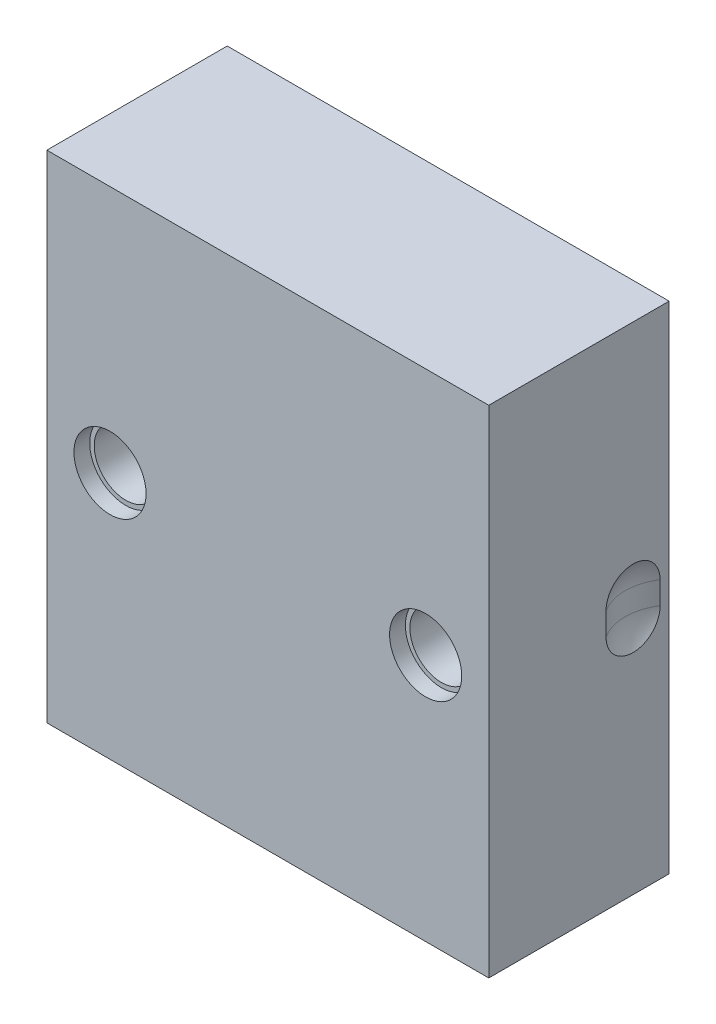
ISO-10303-21;
HEADER;
FILE_DESCRIPTION(('STEP AP214'),'2;1');
FILE_NAME('part.step','',(''),(''),'','','');
FILE_SCHEMA(('AUTOMOTIVE_DESIGN { 1 0 10303 214 1 1 1 1 }'));
ENDSEC;
DATA;
#1=APPLICATION_CONTEXT('core data for automotive mechanical design processes');
#2=APPLICATION_PROTOCOL_DEFINITION('international standard','automotive_design',2000,#1);
#3=PRODUCT_CONTEXT('',#1,'mechanical');
#4=PRODUCT('Part','Part','',(#3));
#5=PRODUCT_RELATED_PRODUCT_CATEGORY('part','',(#4));
#6=PRODUCT_DEFINITION_FORMATION('','',#4);
#7=PRODUCT_DEFINITION_CONTEXT('part definition',#1,'design');
#8=PRODUCT_DEFINITION('design','',#6,#7);
#9=PRODUCT_DEFINITION_SHAPE('','',#8);
#10=(LENGTH_UNIT() NAMED_UNIT(*) SI_UNIT(.MILLI.,.METRE.));
#11=(NAMED_UNIT(*) PLANE_ANGLE_UNIT() SI_UNIT($,.RADIAN.));
#12=(NAMED_UNIT(*) SI_UNIT($,.STERADIAN.) SOLID_ANGLE_UNIT());
#13=UNCERTAINTY_MEASURE_WITH_UNIT(LENGTH_MEASURE(1.E-05),#10,'distance_accuracy_value','');
#14=(GEOMETRIC_REPRESENTATION_CONTEXT(3) GLOBAL_UNCERTAINTY_ASSIGNED_CONTEXT((#13)) GLOBAL_UNIT_ASSIGNED_CONTEXT((#10,
#11,#12)) REPRESENTATION_CONTEXT('',''));
#15=CARTESIAN_POINT('',(0.,0.,0.));
#16=DIRECTION('',(0.,0.,1.));
#17=DIRECTION('',(1.,0.,0.));
#18=AXIS2_PLACEMENT_3D('',#15,#16,#17);
#19=CARTESIAN_POINT('',(83.9999999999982,193.,38.25));
#20=DIRECTION('',(0.,0.,-1.));
#21=DIRECTION('',(-1.,0.,0.));
#22=AXIS2_PLACEMENT_3D('',#19,#20,#21);
#23=CYLINDRICAL_SURFACE('',#22,8.);
#24=CARTESIAN_POINT('',(83.9999999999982,193.,36.5));
#25=DIRECTION('',(0.,0.,1.));
#26=DIRECTION('',(1.,0.,0.));
#27=AXIS2_PLACEMENT_3D('',#24,#25,#26);
#28=CIRCLE('',#27,8.);
#29=CARTESIAN_POINT('',(91.9999999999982,193.,36.5));
#30=VERTEX_POINT('',#29);
#31=EDGE_CURVE('E1124',#30,#30,#28,.T.);
#32=ORIENTED_EDGE('',*,*,#31,.F.);
#33=EDGE_LOOP('',(#32));
#34=FACE_BOUND('',#33,.T.);
#35=CARTESIAN_POINT('',(83.9999999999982,193.,40.));
#36=DIRECTION('',(0.,0.,1.));
#37=DIRECTION('',(1.,0.,0.));
#38=AXIS2_PLACEMENT_3D('',#35,#36,#37);
#39=CIRCLE('',#38,8.);
#40=CARTESIAN_POINT('',(91.9999999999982,193.,40.));
#41=VERTEX_POINT('',#40);
#42=EDGE_CURVE('E1258',#41,#41,#39,.F.);
#43=ORIENTED_EDGE('',*,*,#42,.F.);
#44=EDGE_LOOP('',(#43));
#45=FACE_BOUND('',#44,.T.);
#46=ADVANCED_FACE('F14',(#34,#45),#23,.F.);
#47=CARTESIAN_POINT('',(13.9999999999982,193.,38.25));
#48=DIRECTION('',(0.,0.,-1.));
#49=DIRECTION('',(-1.,0.,0.));
#50=AXIS2_PLACEMENT_3D('',#47,#48,#49);
#51=CYLINDRICAL_SURFACE('',#50,8.);
#52=CARTESIAN_POINT('',(13.9999999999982,193.,36.5));
#53=DIRECTION('',(0.,0.,1.));
#54=DIRECTION('',(1.,0.,0.));
#55=AXIS2_PLACEMENT_3D('',#52,#53,#54);
#56=CIRCLE('',#55,8.);
#57=CARTESIAN_POINT('',(21.9999999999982,193.,36.5));
#58=VERTEX_POINT('',#57);
#59=EDGE_CURVE('E515',#58,#58,#56,.T.);
#60=ORIENTED_EDGE('',*,*,#59,.F.);
#61=EDGE_LOOP('',(#60));
#62=FACE_BOUND('',#61,.T.);
#63=CARTESIAN_POINT('',(13.9999999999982,193.,40.));
#64=DIRECTION('',(0.,0.,1.));
#65=DIRECTION('',(1.,0.,0.));
#66=AXIS2_PLACEMENT_3D('',#63,#64,#65);
#67=CIRCLE('',#66,8.);
#68=CARTESIAN_POINT('',(21.9999999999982,193.,40.));
#69=VERTEX_POINT('',#68);
#70=EDGE_CURVE('E1255',#69,#69,#67,.F.);
#71=ORIENTED_EDGE('',*,*,#70,.F.);
#72=EDGE_LOOP('',(#71));
#73=FACE_BOUND('',#72,.T.);
#74=ADVANCED_FACE('F484',(#62,#73),#51,.F.);
#75=CARTESIAN_POINT('',(98.,193.,15.589136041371));
#76=DIRECTION('',(-1.,0.,0.));
#77=DIRECTION('',(0.,0.,1.));
#78=AXIS2_PLACEMENT_3D('',#75,#76,#77);
#79=PLANE('',#78);
#80=DIRECTION('',(0.,1.,0.));
#81=VECTOR('',#80,1.);
#82=CARTESIAN_POINT('',(98.,193.,2.0021337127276));
#83=LINE('',#82,#81);
#84=CARTESIAN_POINT('',(98.,190.497866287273,2.00213371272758));
#85=VERTEX_POINT('',#84);
#86=CARTESIAN_POINT('',(98.,195.502133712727,2.00213371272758));
#87=VERTEX_POINT('',#86);
#88=EDGE_CURVE('E217',#85,#87,#83,.T.);
#89=ORIENTED_EDGE('',*,*,#88,.F.);
#90=CARTESIAN_POINT('',(98.,190.497866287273,13.9978662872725));
#91=CARTESIAN_POINT('',(98.,190.329174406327,13.9978844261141));
#92=CARTESIAN_POINT('',(98.,190.16048513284,13.9907502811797));
#93=CARTESIAN_POINT('',(98.,189.824313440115,13.9623084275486));
#94=CARTESIAN_POINT('',(98.,189.656830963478,13.9410013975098));
#95=CARTESIAN_POINT('',(98.,189.324375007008,13.8843646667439));
#96=CARTESIAN_POINT('',(98.,189.159399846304,13.8490448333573));
#97=CARTESIAN_POINT('',(98.,188.833011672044,13.7646394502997));
#98=CARTESIAN_POINT('',(98.,188.671598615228,13.7155540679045));
#99=CARTESIAN_POINT('',(98.,188.353433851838,13.6039486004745));
#100=CARTESIAN_POINT('',(98.,188.196683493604,13.5414246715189));
#101=CARTESIAN_POINT('',(98.,187.888949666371,13.4033696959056));
#102=CARTESIAN_POINT('',(98.,187.737968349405,13.3278338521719));
#103=CARTESIAN_POINT('',(98.,187.442991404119,13.1643545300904));
#104=CARTESIAN_POINT('',(98.,187.298991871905,13.0764180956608));
#105=CARTESIAN_POINT('',(98.,187.018858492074,12.8886955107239));
#106=CARTESIAN_POINT('',(98.,186.882727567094,12.7889049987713));
#107=CARTESIAN_POINT('',(98.,186.619402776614,12.5782464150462));
#108=CARTESIAN_POINT('',(98.,186.492205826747,12.4673821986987));
#109=CARTESIAN_POINT('',(98.,186.247555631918,12.2352921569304));
#110=CARTESIAN_POINT('',(98.,186.130106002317,12.1140625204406));
#111=CARTESIAN_POINT('',(98.,185.905862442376,11.8621663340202));
#112=CARTESIAN_POINT('',(98.,185.799066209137,11.7315018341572));
#113=CARTESIAN_POINT('',(98.,185.596822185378,11.4615915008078));
#114=CARTESIAN_POINT('',(98.,185.501378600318,11.3223425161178));
#115=CARTESIAN_POINT('',(98.,185.322601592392,11.0363565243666));
#116=CARTESIAN_POINT('',(98.,185.239263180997,10.8896226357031));
#117=CARTESIAN_POINT('',(98.,185.085213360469,10.5896012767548));
#118=CARTESIAN_POINT('',(98.,185.014506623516,10.4363114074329));
#119=CARTESIAN_POINT('',(98.,184.886288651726,10.124386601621));
#120=CARTESIAN_POINT('',(98.,184.828771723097,9.96575400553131));
#121=CARTESIAN_POINT('',(98.,184.72728423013,9.6441488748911));
#122=CARTESIAN_POINT('',(98.,184.683318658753,9.4811747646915));
#123=CARTESIAN_POINT('',(98.,184.609287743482,9.15215730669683));
#124=CARTESIAN_POINT('',(98.,184.579217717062,8.98611501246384));
#125=CARTESIAN_POINT('',(98.,184.533161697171,8.65202957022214));
#126=CARTESIAN_POINT('',(98.,184.517180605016,8.48398574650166));
#127=CARTESIAN_POINT('',(98.,184.499435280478,8.14717457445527));
#128=CARTESIAN_POINT('',(98.,184.497668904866,7.97840733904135));
#129=CARTESIAN_POINT('',(98.,184.508359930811,7.64132399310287));
#130=CARTESIAN_POINT('',(98.,184.520817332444,7.47300788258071));
#131=CARTESIAN_POINT('',(98.,184.55987056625,7.13799594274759));
#132=CARTESIAN_POINT('',(98.,184.586468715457,6.97130038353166));
#133=CARTESIAN_POINT('',(98.,184.653604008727,6.6408006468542));
#134=CARTESIAN_POINT('',(98.,184.694136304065,6.47699548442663));
#135=CARTESIAN_POINT('',(98.,184.788870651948,6.15332369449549));
#136=CARTESIAN_POINT('',(98.,184.84307754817,5.99345848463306));
#137=CARTESIAN_POINT('',(98.,184.964746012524,5.67892185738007));
#138=CARTESIAN_POINT('',(98.,185.032202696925,5.52424855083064));
#139=CARTESIAN_POINT('',(98.,185.179933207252,5.22107326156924));
#140=CARTESIAN_POINT('',(98.,185.260212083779,5.07257373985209));
#141=CARTESIAN_POINT('',(98.,185.432964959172,4.78292062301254));
#142=CARTESIAN_POINT('',(98.,185.525434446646,4.64176433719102));
#143=CARTESIAN_POINT('',(98.,185.721965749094,4.36769807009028));
#144=CARTESIAN_POINT('',(98.,185.826031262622,4.23479074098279));
#145=CARTESIAN_POINT('',(98.,186.044949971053,3.97826422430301));
#146=CARTESIAN_POINT('',(98.,186.159799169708,3.85464162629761));
#147=CARTESIAN_POINT('',(98.,186.399529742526,3.61748095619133));
#148=CARTESIAN_POINT('',(98.,186.524413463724,3.50394525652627));
#149=CARTESIAN_POINT('',(98.,186.783253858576,3.28783815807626));
#150=CARTESIAN_POINT('',(98.,186.917207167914,3.18526272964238));
#151=CARTESIAN_POINT('',(98.,187.193371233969,2.99169028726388));
#152=CARTESIAN_POINT('',(98.,187.335587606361,2.90070128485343));
#153=CARTESIAN_POINT('',(98.,187.62712835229,2.73106306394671));
#154=CARTESIAN_POINT('',(98.,187.776450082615,2.65240930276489));
#155=CARTESIAN_POINT('',(98.,188.081338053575,2.50788927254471));
#156=CARTESIAN_POINT('',(98.,188.236910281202,2.44203563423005));
#157=CARTESIAN_POINT('',(98.,188.552995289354,2.32370341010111));
#158=CARTESIAN_POINT('',(98.,188.713506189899,2.27121980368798));
#159=CARTESIAN_POINT('',(98.,189.038197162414,2.18001946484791));
#160=CARTESIAN_POINT('',(98.,189.202372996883,2.14128762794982));
#161=CARTESIAN_POINT('',(98.,189.533337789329,2.07779977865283));
#162=CARTESIAN_POINT('',(98.,189.700125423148,2.05303690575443));
#163=CARTESIAN_POINT('',(98.,189.972374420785,2.02426918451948));
#164=CARTESIAN_POINT('',(98.,190.077399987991,2.01596309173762));
#165=CARTESIAN_POINT('',(98.,190.287568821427,2.00489933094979));
#166=CARTESIAN_POINT('',(98.,190.392711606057,2.00213251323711));
#167=CARTESIAN_POINT('',(98.,190.497866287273,2.00213371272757));
#168=B_SPLINE_CURVE_WITH_KNOTS('',3,(#90,#91,#92,#93,#94,#95,#96,#97,#98,#99,#100,#101,#102,
#103,#104,#105,#106,#107,#108,#109,#110,#111,#112,#113,#114,#115,#116,#117,#118,#119,#120,#121,
#122,#123,#124,#125,#126,#127,#128,#129,#130,#131,#132,#133,#134,#135,#136,#137,#138,#139,#140,
#141,#142,#143,#144,#145,#146,#147,#148,#149,#150,#151,#152,#153,#154,#155,#156,#157,#158,#159,
#160,#161,#162,#163,#164,#165,#166,#167),.UNSPECIFIED.,.F.,.F.,(4,2,2,2,2,2,2,2,2,2,2,2,2,2,2,2,
2,2,2,2,2,2,2,2,2,2,2,2,2,2,2,2,2,2,2,2,2,2,4),(0.,0.505921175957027,1.01181812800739,
1.51735947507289,2.02289467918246,2.5285746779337,3.03444150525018,3.54002213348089,
4.04578935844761,4.551381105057,5.05715954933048,5.56282842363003,6.06868403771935,
6.57433059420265,7.08016379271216,7.58577821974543,8.09157871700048,8.59720864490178,
9.10301440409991,9.60874389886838,10.114473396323,10.6202857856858,11.1259223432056,
11.6317382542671,12.1373680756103,12.6431975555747,13.1488403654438,13.6546449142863,
14.1602627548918,14.6659992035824,15.171549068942,15.677446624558,16.1831574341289,
16.6893647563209,17.1953817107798,17.7008411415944,18.2060521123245,18.5219783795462,
18.8373823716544),.UNSPECIFIED.);
#169=CARTESIAN_POINT('',(98.,190.497866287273,13.9978662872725));
#170=VERTEX_POINT('',#169);
#171=EDGE_CURVE('E203',#170,#85,#168,.T.);
#172=ORIENTED_EDGE('',*,*,#171,.F.);
#173=DIRECTION('',(0.,1.,0.));
#174=VECTOR('',#173,1.);
#175=CARTESIAN_POINT('',(98.,193.,13.9978662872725));
#176=LINE('',#175,#174);
#177=CARTESIAN_POINT('',(98.,195.502133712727,13.9978662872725));
#178=VERTEX_POINT('',#177);
#179=EDGE_CURVE('E215',#178,#170,#176,.F.);
#180=ORIENTED_EDGE('',*,*,#179,.F.);
#181=CARTESIAN_POINT('',(98.,195.502133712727,2.00213371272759));
#182=CARTESIAN_POINT('',(98.,195.670825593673,2.00211557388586));
#183=CARTESIAN_POINT('',(98.,195.83951486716,2.00924971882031));
#184=CARTESIAN_POINT('',(98.,196.175686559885,2.03769157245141));
#185=CARTESIAN_POINT('',(98.,196.343169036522,2.05899860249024));
#186=CARTESIAN_POINT('',(98.,196.675624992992,2.11563533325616));
#187=CARTESIAN_POINT('',(98.,196.840600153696,2.15095516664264));
#188=CARTESIAN_POINT('',(98.,197.166988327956,2.23536054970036));
#189=CARTESIAN_POINT('',(98.,197.328401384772,2.28444593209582));
#190=CARTESIAN_POINT('',(98.,197.646566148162,2.3960513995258));
#191=CARTESIAN_POINT('',(98.,197.803316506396,2.45857532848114));
#192=CARTESIAN_POINT('',(98.,198.111050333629,2.59663030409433));
#193=CARTESIAN_POINT('',(98.,198.262031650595,2.67216614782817));
#194=CARTESIAN_POINT('',(98.,198.557008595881,2.83564546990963));
#195=CARTESIAN_POINT('',(98.,198.701008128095,2.92358190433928));
#196=CARTESIAN_POINT('',(98.,198.981141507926,3.11130448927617));
#197=CARTESIAN_POINT('',(98.,199.117272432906,3.21109500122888));
#198=CARTESIAN_POINT('',(98.,199.380597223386,3.42175358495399));
#199=CARTESIAN_POINT('',(98.,199.507794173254,3.53261780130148));
#200=CARTESIAN_POINT('',(98.,199.752444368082,3.76470784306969));
#201=CARTESIAN_POINT('',(98.,199.869893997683,3.88593747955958));
#202=CARTESIAN_POINT('',(98.,200.094137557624,4.13783366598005));
#203=CARTESIAN_POINT('',(98.,200.200933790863,4.26849816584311));
#204=CARTESIAN_POINT('',(98.,200.403177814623,4.53840849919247));
#205=CARTESIAN_POINT('',(98.,200.498621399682,4.67765748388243));
#206=CARTESIAN_POINT('',(98.,200.677398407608,4.96364347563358));
#207=CARTESIAN_POINT('',(98.,200.760736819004,5.11037736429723));
#208=CARTESIAN_POINT('',(98.,200.914786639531,5.41039872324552));
#209=CARTESIAN_POINT('',(98.,200.985493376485,5.56368859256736));
#210=CARTESIAN_POINT('',(98.,201.113711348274,5.87561339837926));
#211=CARTESIAN_POINT('',(98.,201.171228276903,6.03424599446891));
#212=CARTESIAN_POINT('',(98.,201.27271576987,6.35585112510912));
#213=CARTESIAN_POINT('',(98.,201.316681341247,6.51882523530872));
#214=CARTESIAN_POINT('',(98.,201.390712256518,6.8478426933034));
#215=CARTESIAN_POINT('',(98.,201.420782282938,7.01388498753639));
#216=CARTESIAN_POINT('',(98.,201.466838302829,7.3479704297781));
#217=CARTESIAN_POINT('',(98.,201.482819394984,7.51601425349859));
#218=CARTESIAN_POINT('',(98.,201.500564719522,7.85282542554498));
#219=CARTESIAN_POINT('',(98.,201.502331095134,8.02159266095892));
#220=CARTESIAN_POINT('',(98.,201.491640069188,8.3586760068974));
#221=CARTESIAN_POINT('',(98.,201.479182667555,8.52699211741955));
#222=CARTESIAN_POINT('',(98.,201.44012943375,8.86200405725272));
#223=CARTESIAN_POINT('',(98.,201.413531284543,9.0286996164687));
#224=CARTESIAN_POINT('',(98.,201.346395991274,9.35919935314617));
#225=CARTESIAN_POINT('',(98.,201.305863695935,9.5230045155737));
#226=CARTESIAN_POINT('',(98.,201.211129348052,9.84667630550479));
#227=CARTESIAN_POINT('',(98.,201.15692245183,10.0065415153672));
#228=CARTESIAN_POINT('',(98.,201.035253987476,10.3210781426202));
#229=CARTESIAN_POINT('',(98.,200.967797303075,10.4757514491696));
#230=CARTESIAN_POINT('',(98.,200.820066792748,10.778926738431));
#231=CARTESIAN_POINT('',(98.,200.739787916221,10.9274262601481));
#232=CARTESIAN_POINT('',(98.,200.567035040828,11.2170793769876));
#233=CARTESIAN_POINT('',(98.,200.474565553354,11.3582356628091));
#234=CARTESIAN_POINT('',(98.,200.278034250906,11.6323019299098));
#235=CARTESIAN_POINT('',(98.,200.173968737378,11.7652092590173));
#236=CARTESIAN_POINT('',(98.,199.955050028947,12.0217357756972));
#237=CARTESIAN_POINT('',(98.,199.840200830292,12.1453583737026));
#238=CARTESIAN_POINT('',(98.,199.600470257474,12.3825190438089));
#239=CARTESIAN_POINT('',(98.,199.475586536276,12.4960547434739));
#240=CARTESIAN_POINT('',(98.,199.216746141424,12.7121618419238));
#241=CARTESIAN_POINT('',(98.,199.082792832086,12.8147372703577));
#242=CARTESIAN_POINT('',(98.,198.806628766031,13.0083097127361));
#243=CARTESIAN_POINT('',(98.,198.664412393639,13.0992987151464));
#244=CARTESIAN_POINT('',(98.,198.37287164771,13.2689369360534));
#245=CARTESIAN_POINT('',(98.,198.223549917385,13.3475906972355));
#246=CARTESIAN_POINT('',(98.,197.918661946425,13.4921107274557));
#247=CARTESIAN_POINT('',(98.,197.763089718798,13.55796436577));
#248=CARTESIAN_POINT('',(98.,197.447004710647,13.6762965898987));
#249=CARTESIAN_POINT('',(98.,197.286493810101,13.728780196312));
#250=CARTESIAN_POINT('',(98.,196.961802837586,13.8199805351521));
#251=CARTESIAN_POINT('',(98.,196.797627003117,13.8587123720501));
#252=CARTESIAN_POINT('',(98.,196.466662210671,13.9222002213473));
#253=CARTESIAN_POINT('',(98.,196.299874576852,13.946963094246));
#254=CARTESIAN_POINT('',(98.,196.027625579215,13.9757308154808));
#255=CARTESIAN_POINT('',(98.,195.922600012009,13.9840369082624));
#256=CARTESIAN_POINT('',(98.,195.712431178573,13.9951006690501));
#257=CARTESIAN_POINT('',(98.,195.607288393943,13.9978674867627));
#258=CARTESIAN_POINT('',(98.,195.502133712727,13.9978662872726));
#259=B_SPLINE_CURVE_WITH_KNOTS('',3,(#181,#182,#183,#184,#185,#186,#187,#188,#189,#190,#191,
#192,#193,#194,#195,#196,#197,#198,#199,#200,#201,#202,#203,#204,#205,#206,#207,#208,#209,#210,
#211,#212,#213,#214,#215,#216,#217,#218,#219,#220,#221,#222,#223,#224,#225,#226,#227,#228,#229,
#230,#231,#232,#233,#234,#235,#236,#237,#238,#239,#240,#241,#242,#243,#244,#245,#246,#247,#248,
#249,#250,#251,#252,#253,#254,#255,#256,#257,#258),.UNSPECIFIED.,.F.,.F.,(4,2,2,2,2,2,2,2,2,2,2,
2,2,2,2,2,2,2,2,2,2,2,2,2,2,2,2,2,2,2,2,2,2,2,2,2,2,2,4),(0.,0.505921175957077,1.01181812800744,
1.51735947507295,2.02289467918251,2.52857467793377,3.03444150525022,3.54002213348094,
4.04578935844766,4.55138110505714,5.0571595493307,5.56282842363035,6.06868403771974,
6.57433059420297,7.08016379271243,7.58577821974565,8.09157871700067,8.597208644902,
9.10301440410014,9.60874389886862,10.1144733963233,10.6202857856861,11.1259223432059,
11.6317382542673,12.1373680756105,12.6431975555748,13.1488403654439,13.6546449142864,
14.1602627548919,14.6659992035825,15.171549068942,15.6774466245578,16.1831574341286,
16.6893647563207,17.1953817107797,17.7008411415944,18.2060521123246,18.5219783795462,
18.8373823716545),.UNSPECIFIED.);
#260=EDGE_CURVE('E232',#87,#178,#259,.T.);
#261=ORIENTED_EDGE('',*,*,#260,.F.);
#262=EDGE_LOOP('',(#89,#172,#180,#261));
#263=FACE_BOUND('',#262,.T.);
#264=DIRECTION('',(0.,1.,0.));
#265=VECTOR('',#264,1.);
#266=CARTESIAN_POINT('',(98.,138.,40.));
#267=LINE('',#266,#265);
#268=CARTESIAN_POINT('',(98.,138.,40.));
#269=VERTEX_POINT('',#268);
#270=CARTESIAN_POINT('',(98.,248.,40.));
#271=VERTEX_POINT('',#270);
#272=EDGE_CURVE('E1250',#269,#271,#267,.T.);
#273=ORIENTED_EDGE('',*,*,#272,.F.);
#274=DIRECTION('',(0.,0.,1.));
#275=VECTOR('',#274,1.);
#276=CARTESIAN_POINT('',(98.,138.,15.589136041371));
#277=LINE('',#276,#275);
#278=CARTESIAN_POINT('',(98.,138.,0.));
#279=VERTEX_POINT('',#278);
#280=EDGE_CURVE('E236',#269,#279,#277,.F.);
#281=ORIENTED_EDGE('',*,*,#280,.T.);
#282=DIRECTION('',(0.,-1.,0.));
#283=VECTOR('',#282,1.);
#284=CARTESIAN_POINT('',(98.,193.,0.));
#285=LINE('',#284,#283);
#286=CARTESIAN_POINT('',(98.,248.,0.));
#287=VERTEX_POINT('',#286);
#288=EDGE_CURVE('E309',#279,#287,#285,.F.);
#289=ORIENTED_EDGE('',*,*,#288,.T.);
#290=DIRECTION('',(0.,0.,-1.));
#291=VECTOR('',#290,1.);
#292=CARTESIAN_POINT('',(98.,248.,15.589136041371));
#293=LINE('',#292,#291);
#294=EDGE_CURVE('E228',#287,#271,#293,.F.);
#295=ORIENTED_EDGE('',*,*,#294,.T.);
#296=EDGE_LOOP('',(#273,#281,#289,#295));
#297=FACE_BOUND('',#296,.T.);
#298=ADVANCED_FACE('F212',(#263,#297),#79,.F.);
#299=CARTESIAN_POINT('',(49.,248.,15.589136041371));
#300=DIRECTION('',(0.,-1.,0.));
#301=DIRECTION('',(0.,0.,-1.));
#302=AXIS2_PLACEMENT_3D('',#299,#300,#301);
#303=PLANE('',#302);
#304=DIRECTION('',(-1.,0.,0.));
#305=VECTOR('',#304,1.);
#306=CARTESIAN_POINT('',(98.,248.,40.));
#307=LINE('',#306,#305);
#308=CARTESIAN_POINT('',(0.,248.,40.));
#309=VERTEX_POINT('',#308);
#310=EDGE_CURVE('E1239',#271,#309,#307,.T.);
#311=ORIENTED_EDGE('',*,*,#310,.F.);
#312=ORIENTED_EDGE('',*,*,#294,.F.);
#313=DIRECTION('',(1.,0.,0.));
#314=VECTOR('',#313,1.);
#315=CARTESIAN_POINT('',(49.,248.,0.));
#316=LINE('',#315,#314);
#317=CARTESIAN_POINT('',(0.,248.,0.));
#318=VERTEX_POINT('',#317);
#319=EDGE_CURVE('E306',#287,#318,#316,.F.);
#320=ORIENTED_EDGE('',*,*,#319,.T.);
#321=DIRECTION('',(0.,0.,-1.));
#322=VECTOR('',#321,1.);
#323=CARTESIAN_POINT('',(0.,248.,15.589136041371));
#324=LINE('',#323,#322);
#325=EDGE_CURVE('E233',#318,#309,#324,.F.);
#326=ORIENTED_EDGE('',*,*,#325,.T.);
#327=EDGE_LOOP('',(#311,#312,#320,#326));
#328=FACE_BOUND('',#327,.T.);
#329=ADVANCED_FACE('F548',(#328),#303,.F.);
#330=CARTESIAN_POINT('',(0.,193.,15.589136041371));
#331=DIRECTION('',(1.,0.,0.));
#332=DIRECTION('',(0.,0.,-1.));
#333=AXIS2_PLACEMENT_3D('',#330,#331,#332);
#334=PLANE('',#333);
#335=DIRECTION('',(0.,1.,0.));
#336=VECTOR('',#335,1.);
#337=CARTESIAN_POINT('',(0.,193.,13.9978662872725));
#338=LINE('',#337,#336);
#339=CARTESIAN_POINT('',(0.,190.497866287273,13.9978662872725));
#340=VERTEX_POINT('',#339);
#341=CARTESIAN_POINT('',(0.,195.502133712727,13.9978662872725));
#342=VERTEX_POINT('',#341);
#343=EDGE_CURVE('E238',#340,#342,#338,.T.);
#344=ORIENTED_EDGE('',*,*,#343,.F.);
#345=CARTESIAN_POINT('',(0.,190.497866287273,2.00213371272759));
#346=CARTESIAN_POINT('',(0.,190.329174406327,2.00211557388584));
#347=CARTESIAN_POINT('',(0.,190.16048513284,2.00924971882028));
#348=CARTESIAN_POINT('',(0.,189.824313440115,2.03769157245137));
#349=CARTESIAN_POINT('',(0.,189.656830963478,2.0589986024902));
#350=CARTESIAN_POINT('',(0.,189.324375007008,2.11563533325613));
#351=CARTESIAN_POINT('',(0.,189.159399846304,2.15095516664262));
#352=CARTESIAN_POINT('',(0.,188.833011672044,2.23536054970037));
#353=CARTESIAN_POINT('',(0.,188.671598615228,2.28444593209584));
#354=CARTESIAN_POINT('',(0.,188.353433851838,2.39605139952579));
#355=CARTESIAN_POINT('',(0.,188.196683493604,2.45857532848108));
#356=CARTESIAN_POINT('',(0.,187.888949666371,2.59663030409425));
#357=CARTESIAN_POINT('',(0.,187.737968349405,2.67216614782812));
#358=CARTESIAN_POINT('',(0.,187.442991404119,2.83564546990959));
#359=CARTESIAN_POINT('',(0.,187.298991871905,2.92358190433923));
#360=CARTESIAN_POINT('',(0.,187.018858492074,3.111304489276));
#361=CARTESIAN_POINT('',(-1.79628837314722E-13,186.882727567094,3.21109500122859));
#362=CARTESIAN_POINT('',(-1.77724529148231E-13,186.619402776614,3.42175358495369));
#363=CARTESIAN_POINT('',(0.,186.492205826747,3.53261780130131));
#364=CARTESIAN_POINT('',(0.,186.247555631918,3.76470784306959));
#365=CARTESIAN_POINT('',(0.,186.130106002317,3.88593747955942));
#366=CARTESIAN_POINT('',(0.,185.905862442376,4.13783366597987));
#367=CARTESIAN_POINT('',(0.,185.799066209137,4.26849816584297));
#368=CARTESIAN_POINT('',(0.,185.596822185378,4.53840849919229));
#369=CARTESIAN_POINT('',(-1.76371022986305E-13,185.501378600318,4.67765748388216));
#370=CARTESIAN_POINT('',(-1.76645147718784E-13,185.322601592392,4.96364347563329));
#371=CARTESIAN_POINT('',(0.,185.239263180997,5.110377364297));
#372=CARTESIAN_POINT('',(0.,185.085213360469,5.41039872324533));
#373=CARTESIAN_POINT('',(0.,185.014506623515,5.56368859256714));
#374=CARTESIAN_POINT('',(0.,184.886288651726,5.87561339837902));
#375=CARTESIAN_POINT('',(0.,184.828771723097,6.03424599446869));
#376=CARTESIAN_POINT('',(0.,184.72728423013,6.35585112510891));
#377=CARTESIAN_POINT('',(-1.46281905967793E-13,184.683318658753,6.51882523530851));
#378=CARTESIAN_POINT('',(-1.46886259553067E-13,184.609287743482,6.84784269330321));
#379=CARTESIAN_POINT('',(0.,184.579217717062,7.01388498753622));
#380=CARTESIAN_POINT('',(0.,184.533161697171,7.34797042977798));
#381=CARTESIAN_POINT('',(0.,184.517180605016,7.51601425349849));
#382=CARTESIAN_POINT('',(0.,184.499435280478,7.85282542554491));
#383=CARTESIAN_POINT('',(0.,184.497668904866,8.02159266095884));
#384=CARTESIAN_POINT('',(0.,184.508359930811,8.35867600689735));
#385=CARTESIAN_POINT('',(-1.14838577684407E-13,184.520817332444,8.52699211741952));
#386=CARTESIAN_POINT('',(-1.16313446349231E-13,184.55987056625,8.86200405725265));
#387=CARTESIAN_POINT('',(0.,184.586468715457,9.02869961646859));
#388=CARTESIAN_POINT('',(0.,184.653604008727,9.35919935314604));
#389=CARTESIAN_POINT('',(0.,184.694136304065,9.5230045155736));
#390=CARTESIAN_POINT('',(0.,184.788870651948,9.84667630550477));
#391=CARTESIAN_POINT('',(0.,184.84307754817,10.0065415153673));
#392=CARTESIAN_POINT('',(0.,184.964746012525,10.3210781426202));
#393=CARTESIAN_POINT('',(0.,185.032202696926,10.4757514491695));
#394=CARTESIAN_POINT('',(0.,185.179933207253,10.7789267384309));
#395=CARTESIAN_POINT('',(0.,185.260212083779,10.9274262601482));
#396=CARTESIAN_POINT('',(0.,185.432964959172,11.2170793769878));
#397=CARTESIAN_POINT('',(0.,185.525434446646,11.3582356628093));
#398=CARTESIAN_POINT('',(0.,185.721965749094,11.6323019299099));
#399=CARTESIAN_POINT('',(0.,185.826031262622,11.7652092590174));
#400=CARTESIAN_POINT('',(0.,186.044949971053,12.0217357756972));
#401=CARTESIAN_POINT('',(0.,186.159799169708,12.1453583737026));
#402=CARTESIAN_POINT('',(0.,186.399529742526,12.3825190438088));
#403=CARTESIAN_POINT('',(0.,186.524413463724,12.4960547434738));
#404=CARTESIAN_POINT('',(0.,186.783253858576,12.7121618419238));
#405=CARTESIAN_POINT('',(0.,186.917207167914,12.8147372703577));
#406=CARTESIAN_POINT('',(0.,187.193371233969,13.0083097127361));
#407=CARTESIAN_POINT('',(0.,187.335587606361,13.0992987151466));
#408=CARTESIAN_POINT('',(0.,187.62712835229,13.2689369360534));
#409=CARTESIAN_POINT('',(0.,187.776450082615,13.3475906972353));
#410=CARTESIAN_POINT('',(0.,188.081338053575,13.4921107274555));
#411=CARTESIAN_POINT('',(0.,188.236910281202,13.55796436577));
#412=CARTESIAN_POINT('',(0.,188.552995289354,13.6762965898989));
#413=CARTESIAN_POINT('',(0.,188.713506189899,13.7287801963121));
#414=CARTESIAN_POINT('',(0.,189.038197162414,13.8199805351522));
#415=CARTESIAN_POINT('',(0.,189.202372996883,13.8587123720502));
#416=CARTESIAN_POINT('',(0.,189.533337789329,13.9222002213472));
#417=CARTESIAN_POINT('',(0.,189.700125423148,13.9469630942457));
#418=CARTESIAN_POINT('',(0.,189.972374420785,13.9757308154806));
#419=CARTESIAN_POINT('',(0.,190.077399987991,13.9840369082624));
#420=CARTESIAN_POINT('',(0.,190.287568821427,13.9951006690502));
#421=CARTESIAN_POINT('',(0.,190.392711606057,13.9978674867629));
#422=CARTESIAN_POINT('',(0.,190.497866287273,13.9978662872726));
#423=B_SPLINE_CURVE_WITH_KNOTS('',3,(#345,#346,#347,#348,#349,#350,#351,#352,#353,#354,#355,
#356,#357,#358,#359,#360,#361,#362,#363,#364,#365,#366,#367,#368,#369,#370,#371,#372,#373,#374,
#375,#376,#377,#378,#379,#380,#381,#382,#383,#384,#385,#386,#387,#388,#389,#390,#391,#392,#393,
#394,#395,#396,#397,#398,#399,#400,#401,#402,#403,#404,#405,#406,#407,#408,#409,#410,#411,#412,
#413,#414,#415,#416,#417,#418,#419,#420,#421,#422),.UNSPECIFIED.,.F.,.F.,(4,2,2,2,2,2,2,2,2,2,2,
2,2,2,2,2,2,2,2,2,2,2,2,2,2,2,2,2,2,2,2,2,2,2,2,2,2,2,4),(0.,0.505921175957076,1.01181812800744,
1.51735947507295,2.02289467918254,2.52857467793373,3.03444150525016,3.54002213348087,
4.04578935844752,4.55138110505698,5.05715954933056,5.5628284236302,6.06868403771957,
6.5743305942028,7.08016379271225,7.5857782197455,8.09157871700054,8.59720864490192,
9.10301440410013,9.60874389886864,10.1144733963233,10.6202857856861,11.1259223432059,
11.6317382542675,12.1373680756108,12.6431975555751,13.1488403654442,13.6546449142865,
14.1602627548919,14.6659992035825,15.1715490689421,15.6774466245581,16.1831574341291,
16.689364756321,17.1953817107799,17.7008411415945,18.2060521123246,18.5219783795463,
18.8373823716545),.UNSPECIFIED.);
#424=CARTESIAN_POINT('',(0.,190.497866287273,2.00213371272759));
#425=VERTEX_POINT('',#424);
#426=EDGE_CURVE('E241',#425,#340,#423,.T.);
#427=ORIENTED_EDGE('',*,*,#426,.F.);
#428=DIRECTION('',(0.,1.,0.));
#429=VECTOR('',#428,1.);
#430=CARTESIAN_POINT('',(0.,193.,2.0021337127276));
#431=LINE('',#430,#429);
#432=CARTESIAN_POINT('',(0.,195.502133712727,2.00213371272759));
#433=VERTEX_POINT('',#432);
#434=EDGE_CURVE('E231',#433,#425,#431,.F.);
#435=ORIENTED_EDGE('',*,*,#434,.F.);
#436=CARTESIAN_POINT('',(0.,195.502133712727,13.9978662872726));
#437=CARTESIAN_POINT('',(0.,195.670825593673,13.9978844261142));
#438=CARTESIAN_POINT('',(0.,195.83951486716,13.9907502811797));
#439=CARTESIAN_POINT('',(0.,196.175686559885,13.9623084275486));
#440=CARTESIAN_POINT('',(0.,196.343169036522,13.9410013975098));
#441=CARTESIAN_POINT('',(0.,196.675624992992,13.8843646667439));
#442=CARTESIAN_POINT('',(0.,196.840600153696,13.8490448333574));
#443=CARTESIAN_POINT('',(0.,197.166988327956,13.7646394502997));
#444=CARTESIAN_POINT('',(0.,197.328401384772,13.7155540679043));
#445=CARTESIAN_POINT('',(0.,197.646566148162,13.6039486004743));
#446=CARTESIAN_POINT('',(0.,197.803316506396,13.5414246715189));
#447=CARTESIAN_POINT('',(0.,198.111050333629,13.4033696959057));
#448=CARTESIAN_POINT('',(0.,198.262031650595,13.3278338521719));
#449=CARTESIAN_POINT('',(0.,198.557008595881,13.1643545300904));
#450=CARTESIAN_POINT('',(0.,198.701008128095,13.0764180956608));
#451=CARTESIAN_POINT('',(0.,198.981141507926,12.8886955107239));
#452=CARTESIAN_POINT('',(0.,199.117272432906,12.7889049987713));
#453=CARTESIAN_POINT('',(0.,199.380597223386,12.5782464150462));
#454=CARTESIAN_POINT('',(0.,199.507794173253,12.4673821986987));
#455=CARTESIAN_POINT('',(0.,199.752444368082,12.2352921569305));
#456=CARTESIAN_POINT('',(0.,199.869893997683,12.1140625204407));
#457=CARTESIAN_POINT('',(0.,200.094137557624,11.8621663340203));
#458=CARTESIAN_POINT('',(0.,200.200933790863,11.7315018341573));
#459=CARTESIAN_POINT('',(0.,200.403177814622,11.4615915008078));
#460=CARTESIAN_POINT('',(0.,200.498621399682,11.3223425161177));
#461=CARTESIAN_POINT('',(0.,200.677398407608,11.0363565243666));
#462=CARTESIAN_POINT('',(0.,200.760736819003,10.889622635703));
#463=CARTESIAN_POINT('',(0.,200.914786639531,10.5896012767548));
#464=CARTESIAN_POINT('',(0.,200.985493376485,10.4363114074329));
#465=CARTESIAN_POINT('',(0.,201.113711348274,10.1243866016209));
#466=CARTESIAN_POINT('',(0.,201.171228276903,9.9657540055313));
#467=CARTESIAN_POINT('',(0.,201.27271576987,9.64414887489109));
#468=CARTESIAN_POINT('',(0.,201.316681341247,9.48117476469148));
#469=CARTESIAN_POINT('',(0.,201.390712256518,9.15215730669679));
#470=CARTESIAN_POINT('',(0.,201.420782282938,8.9861150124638));
#471=CARTESIAN_POINT('',(0.,201.466838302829,8.65202957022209));
#472=CARTESIAN_POINT('',(0.,201.482819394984,8.48398574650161));
#473=CARTESIAN_POINT('',(0.,201.500564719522,8.14717457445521));
#474=CARTESIAN_POINT('',(0.,201.502331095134,7.97840733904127));
#475=CARTESIAN_POINT('',(0.,201.491640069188,7.64132399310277));
#476=CARTESIAN_POINT('',(0.,201.479182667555,7.47300788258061));
#477=CARTESIAN_POINT('',(0.,201.44012943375,7.13799594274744));
#478=CARTESIAN_POINT('',(0.,201.413531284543,6.97130038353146));
#479=CARTESIAN_POINT('',(0.,201.346395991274,6.64080064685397));
#480=CARTESIAN_POINT('',(0.,201.305863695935,6.47699548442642));
#481=CARTESIAN_POINT('',(0.,201.211129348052,6.15332369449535));
#482=CARTESIAN_POINT('',(0.,201.15692245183,5.99345848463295));
#483=CARTESIAN_POINT('',(0.,201.035253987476,5.67892185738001));
#484=CARTESIAN_POINT('',(0.,200.967797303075,5.52424855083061));
#485=CARTESIAN_POINT('',(0.,200.820066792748,5.22107326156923));
#486=CARTESIAN_POINT('',(0.,200.739787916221,5.07257373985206));
#487=CARTESIAN_POINT('',(0.,200.567035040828,4.7829206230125));
#488=CARTESIAN_POINT('',(0.,200.474565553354,4.641764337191));
#489=CARTESIAN_POINT('',(0.,200.278034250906,4.36769807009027));
#490=CARTESIAN_POINT('',(0.,200.173968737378,4.23479074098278));
#491=CARTESIAN_POINT('',(0.,199.955050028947,3.97826422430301));
#492=CARTESIAN_POINT('',(0.,199.840200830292,3.85464162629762));
#493=CARTESIAN_POINT('',(0.,199.600470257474,3.61748095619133));
#494=CARTESIAN_POINT('',(0.,199.475586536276,3.50394525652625));
#495=CARTESIAN_POINT('',(0.,199.216746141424,3.28783815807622));
#496=CARTESIAN_POINT('',(0.,199.082792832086,3.18526272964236));
#497=CARTESIAN_POINT('',(0.,198.806628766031,2.99169028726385));
#498=CARTESIAN_POINT('',(0.,198.664412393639,2.90070128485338));
#499=CARTESIAN_POINT('',(0.,198.37287164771,2.73106306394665));
#500=CARTESIAN_POINT('',(0.,198.223549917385,2.65240930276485));
#501=CARTESIAN_POINT('',(0.,197.918661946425,2.50788927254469));
#502=CARTESIAN_POINT('',(0.,197.763089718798,2.44203563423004));
#503=CARTESIAN_POINT('',(0.,197.447004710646,2.3237034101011));
#504=CARTESIAN_POINT('',(0.,197.286493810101,2.27121980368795));
#505=CARTESIAN_POINT('',(0.,196.961802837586,2.18001946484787));
#506=CARTESIAN_POINT('',(0.,196.797627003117,2.14128762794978));
#507=CARTESIAN_POINT('',(0.,196.466662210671,2.07779977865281));
#508=CARTESIAN_POINT('',(0.,196.299874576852,2.05303690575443));
#509=CARTESIAN_POINT('',(0.,196.027625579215,2.02426918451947));
#510=CARTESIAN_POINT('',(0.,195.922600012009,2.0159630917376));
#511=CARTESIAN_POINT('',(0.,195.712431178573,2.00489933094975));
#512=CARTESIAN_POINT('',(0.,195.607288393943,2.00213251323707));
#513=CARTESIAN_POINT('',(0.,195.502133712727,2.00213371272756));
#514=B_SPLINE_CURVE_WITH_KNOTS('',3,(#436,#437,#438,#439,#440,#441,#442,#443,#444,#445,#446,
#447,#448,#449,#450,#451,#452,#453,#454,#455,#456,#457,#458,#459,#460,#461,#462,#463,#464,#465,
#466,#467,#468,#469,#470,#471,#472,#473,#474,#475,#476,#477,#478,#479,#480,#481,#482,#483,#484,
#485,#486,#487,#488,#489,#490,#491,#492,#493,#494,#495,#496,#497,#498,#499,#500,#501,#502,#503,
#504,#505,#506,#507,#508,#509,#510,#511,#512,#513),.UNSPECIFIED.,.F.,.F.,(4,2,2,2,2,2,2,2,2,2,2,
2,2,2,2,2,2,2,2,2,2,2,2,2,2,2,2,2,2,2,2,2,2,2,2,2,2,2,4),(0.,0.505921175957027,1.01181812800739,
1.51735947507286,2.02289467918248,2.52857467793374,3.03444150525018,3.54002213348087,
4.04578935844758,4.55138110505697,5.05715954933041,5.56282842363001,6.06868403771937,
6.5743305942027,7.08016379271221,7.58577821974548,8.09157871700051,8.59720864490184,
9.10301440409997,9.60874389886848,10.1144733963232,10.620285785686,11.1259223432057,
11.6317382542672,12.1373680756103,12.6431975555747,13.1488403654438,13.6546449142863,
14.1602627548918,14.6659992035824,15.171549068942,15.677446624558,16.1831574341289,
16.6893647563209,17.1953817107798,17.7008411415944,18.2060521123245,18.5219783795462,
18.8373823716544),.UNSPECIFIED.);
#515=EDGE_CURVE('E237',#342,#433,#514,.T.);
#516=ORIENTED_EDGE('',*,*,#515,.F.);
#517=EDGE_LOOP('',(#344,#427,#435,#516));
#518=FACE_BOUND('',#517,.T.);
#519=DIRECTION('',(0.,-1.,0.));
#520=VECTOR('',#519,1.);
#521=CARTESIAN_POINT('',(0.,248.,40.));
#522=LINE('',#521,#520);
#523=CARTESIAN_POINT('',(0.,138.,40.));
#524=VERTEX_POINT('',#523);
#525=EDGE_CURVE('E31',#309,#524,#522,.T.);
#526=ORIENTED_EDGE('',*,*,#525,.F.);
#527=ORIENTED_EDGE('',*,*,#325,.F.);
#528=DIRECTION('',(0.,-1.,0.));
#529=VECTOR('',#528,1.);
#530=CARTESIAN_POINT('',(0.,193.,0.));
#531=LINE('',#530,#529);
#532=CARTESIAN_POINT('',(0.,138.,0.));
#533=VERTEX_POINT('',#532);
#534=EDGE_CURVE('E303',#318,#533,#531,.T.);
#535=ORIENTED_EDGE('',*,*,#534,.T.);
#536=DIRECTION('',(0.,0.,1.));
#537=VECTOR('',#536,1.);
#538=CARTESIAN_POINT('',(0.,138.,15.589136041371));
#539=LINE('',#538,#537);
#540=EDGE_CURVE('E244',#533,#524,#539,.T.);
#541=ORIENTED_EDGE('',*,*,#540,.T.);
#542=EDGE_LOOP('',(#526,#527,#535,#541));
#543=FACE_BOUND('',#542,.T.);
#544=ADVANCED_FACE('F553',(#518,#543),#334,.F.);
#545=CARTESIAN_POINT('',(49.,138.,15.589136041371));
#546=DIRECTION('',(0.,1.,0.));
#547=DIRECTION('',(0.,0.,1.));
#548=AXIS2_PLACEMENT_3D('',#545,#546,#547);
#549=PLANE('',#548);
#550=DIRECTION('',(1.,0.,0.));
#551=VECTOR('',#550,1.);
#552=CARTESIAN_POINT('',(0.,138.,40.));
#553=LINE('',#552,#551);
#554=EDGE_CURVE('E1238',#524,#269,#553,.T.);
#555=ORIENTED_EDGE('',*,*,#554,.F.);
#556=ORIENTED_EDGE('',*,*,#540,.F.);
#557=DIRECTION('',(1.,0.,0.));
#558=VECTOR('',#557,1.);
#559=CARTESIAN_POINT('',(49.,138.,0.));
#560=LINE('',#559,#558);
#561=EDGE_CURVE('E300',#533,#279,#560,.T.);
#562=ORIENTED_EDGE('',*,*,#561,.T.);
#563=ORIENTED_EDGE('',*,*,#280,.F.);
#564=EDGE_LOOP('',(#555,#556,#562,#563));
#565=FACE_BOUND('',#564,.T.);
#566=ADVANCED_FACE('F558',(#565),#549,.F.);
#567=CARTESIAN_POINT('',(83.9999999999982,193.,24.));
#568=DIRECTION('',(0.,0.,1.));
#569=DIRECTION('',(1.,0.,0.));
#570=AXIS2_PLACEMENT_3D('',#567,#568,#569);
#571=CYLINDRICAL_SURFACE('',#570,7.);
#572=CARTESIAN_POINT('',(83.9999999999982,193.,8.));
#573=DIRECTION('',(0.,0.,1.));
#574=DIRECTION('',(1.,0.,0.));
#575=AXIS2_PLACEMENT_3D('',#572,#573,#574);
#576=CIRCLE('',#575,7.);
#577=CARTESIAN_POINT('',(90.9999999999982,193.,8.));
#578=VERTEX_POINT('',#577);
#579=EDGE_CURVE('E1126',#578,#578,#576,.T.);
#580=ORIENTED_EDGE('',*,*,#579,.F.);
#581=EDGE_LOOP('',(#580));
#582=FACE_BOUND('',#581,.T.);
#583=CARTESIAN_POINT('',(83.9999999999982,193.,36.5));
#584=DIRECTION('',(0.,0.,1.));
#585=DIRECTION('',(1.,0.,0.));
#586=AXIS2_PLACEMENT_3D('',#583,#584,#585);
#587=CIRCLE('',#586,7.);
#588=CARTESIAN_POINT('',(90.9999999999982,193.,36.5));
#589=VERTEX_POINT('',#588);
#590=EDGE_CURVE('E18',#589,#589,#587,.F.);
#591=ORIENTED_EDGE('',*,*,#590,.F.);
#592=EDGE_LOOP('',(#591));
#593=FACE_BOUND('',#592,.T.);
#594=ADVANCED_FACE('F563',(#582,#593),#571,.F.);
#595=CARTESIAN_POINT('',(13.9999999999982,193.,24.));
#596=DIRECTION('',(0.,0.,1.));
#597=DIRECTION('',(1.,0.,0.));
#598=AXIS2_PLACEMENT_3D('',#595,#596,#597);
#599=CYLINDRICAL_SURFACE('',#598,7.);
#600=CARTESIAN_POINT('',(13.9999999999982,193.,8.0000000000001));
#601=DIRECTION('',(0.,0.,1.));
#602=DIRECTION('',(1.,0.,0.));
#603=AXIS2_PLACEMENT_3D('',#600,#601,#602);
#604=CIRCLE('',#603,7.);
#605=CARTESIAN_POINT('',(20.9999999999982,193.,8.0000000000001));
#606=VERTEX_POINT('',#605);
#607=EDGE_CURVE('E1119',#606,#606,#604,.T.);
#608=ORIENTED_EDGE('',*,*,#607,.F.);
#609=EDGE_LOOP('',(#608));
#610=FACE_BOUND('',#609,.T.);
#611=CARTESIAN_POINT('',(13.9999999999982,193.,36.5));
#612=DIRECTION('',(0.,0.,1.));
#613=DIRECTION('',(1.,0.,0.));
#614=AXIS2_PLACEMENT_3D('',#611,#612,#613);
#615=CIRCLE('',#614,7.);
#616=CARTESIAN_POINT('',(20.9999999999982,193.,36.5));
#617=VERTEX_POINT('',#616);
#618=EDGE_CURVE('E1122',#617,#617,#615,.F.);
#619=ORIENTED_EDGE('',*,*,#618,.F.);
#620=EDGE_LOOP('',(#619));
#621=FACE_BOUND('',#620,.T.);
#622=ADVANCED_FACE('F727',(#610,#621),#599,.F.);
#623=CARTESIAN_POINT('',(13.9999999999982,193.,8.0000000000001));
#624=DIRECTION('',(0.,0.,-1.));
#625=DIRECTION('',(-1.,0.,0.));
#626=AXIS2_PLACEMENT_3D('',#623,#624,#625);
#627=PLANE('',#626);
#628=ORIENTED_EDGE('',*,*,#607,.T.);
#629=EDGE_LOOP('',(#628));
#630=FACE_BOUND('',#629,.T.);
#631=CARTESIAN_POINT('',(13.9999999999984,193.,8.0000000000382));
#632=DIRECTION('',(0.,0.,1.));
#633=DIRECTION('',(1.,0.,0.));
#634=AXIS2_PLACEMENT_3D('',#631,#632,#633);
#635=CIRCLE('',#634,5.00000000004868);
#636=CARTESIAN_POINT('',(19.0000000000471,193.,8.0000000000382));
#637=VERTEX_POINT('',#636);
#638=EDGE_CURVE('E1132',#637,#637,#635,.F.);
#639=ORIENTED_EDGE('',*,*,#638,.T.);
#640=EDGE_LOOP('',(#639));
#641=FACE_BOUND('',#640,.T.);
#642=ADVANCED_FACE('F774',(#630,#641),#627,.F.);
#643=CARTESIAN_POINT('',(83.9999999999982,193.,8.));
#644=DIRECTION('',(0.,0.,-1.));
#645=DIRECTION('',(-1.,0.,0.));
#646=AXIS2_PLACEMENT_3D('',#643,#644,#645);
#647=PLANE('',#646);
#648=ORIENTED_EDGE('',*,*,#579,.T.);
#649=EDGE_LOOP('',(#648));
#650=FACE_BOUND('',#649,.T.);
#651=CARTESIAN_POINT('',(83.9999999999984,193.,8.0000000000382));
#652=DIRECTION('',(0.,0.,1.));
#653=DIRECTION('',(1.,0.,0.));
#654=AXIS2_PLACEMENT_3D('',#651,#652,#653);
#655=CIRCLE('',#654,5.00000000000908);
#656=CARTESIAN_POINT('',(89.0000000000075,193.,8.0000000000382));
#657=VERTEX_POINT('',#656);
#658=EDGE_CURVE('E409',#657,#657,#655,.F.);
#659=ORIENTED_EDGE('',*,*,#658,.T.);
#660=EDGE_LOOP('',(#659));
#661=FACE_BOUND('',#660,.T.);
#662=ADVANCED_FACE('F803',(#650,#661),#647,.F.);
#663=CARTESIAN_POINT('',(13.9999999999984,193.,7.99999999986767));
#664=DIRECTION('',(0.,0.,1.));
#665=DIRECTION('',(1.,0.,0.));
#666=AXIS2_PLACEMENT_3D('',#663,#664,#665);
#667=CONICAL_SURFACE('',#666,4.99999999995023,0.523598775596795);
#668=CARTESIAN_POINT('',(13.9999999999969,193.,6.61435935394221));
#669=DIRECTION('',(6.56531207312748E-13,-5.27037872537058E-13,-1.));
#670=DIRECTION('',(-1.,0.,-6.56531207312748E-13));
#671=AXIS2_PLACEMENT_3D('',#668,#669,#670);
#672=CIRCLE('',#671,4.2);
#673=CARTESIAN_POINT('',(9.79999999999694,193.,6.61435935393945));
#674=VERTEX_POINT('',#673);
#675=EDGE_CURVE('E406',#674,#674,#672,.T.);
#676=ORIENTED_EDGE('',*,*,#675,.T.);
#677=EDGE_LOOP('',(#676));
#678=FACE_BOUND('',#677,.T.);
#679=ORIENTED_EDGE('',*,*,#638,.F.);
#680=EDGE_LOOP('',(#679));
#681=FACE_BOUND('',#680,.T.);
#682=ADVANCED_FACE('F812',(#678,#681),#667,.F.);
#683=CARTESIAN_POINT('',(83.9999999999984,193.,7.99999999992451));
#684=DIRECTION('',(0.,0.,1.));
#685=DIRECTION('',(1.,0.,0.));
#686=AXIS2_PLACEMENT_3D('',#683,#684,#685);
#687=CONICAL_SURFACE('',#686,4.99999999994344,0.523598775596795);
#688=ORIENTED_EDGE('',*,*,#658,.F.);
#689=EDGE_LOOP('',(#688));
#690=FACE_BOUND('',#689,.T.);
#691=CARTESIAN_POINT('',(83.9999999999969,193.,6.61435935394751));
#692=DIRECTION('',(6.07971206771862E-13,-4.81229605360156E-13,-1.));
#693=DIRECTION('',(-1.,0.,-6.07971206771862E-13));
#694=AXIS2_PLACEMENT_3D('',#691,#692,#693);
#695=CIRCLE('',#694,4.2);
#696=CARTESIAN_POINT('',(79.7999999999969,193.,6.61435935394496));
#697=VERTEX_POINT('',#696);
#698=EDGE_CURVE('E402',#697,#697,#695,.T.);
#699=ORIENTED_EDGE('',*,*,#698,.T.);
#700=EDGE_LOOP('',(#699));
#701=FACE_BOUND('',#700,.T.);
#702=ADVANCED_FACE('F820',(#690,#701),#687,.F.);
#703=CARTESIAN_POINT('',(13.9999999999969,193.,6.61435935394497));
#704=DIRECTION('',(6.56531207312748E-13,-5.27037872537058E-13,-1.));
#705=DIRECTION('',(-1.,0.,-6.56531207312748E-13));
#706=AXIS2_PLACEMENT_3D('',#703,#704,#705);
#707=CYLINDRICAL_SURFACE('',#706,4.2);
#708=CARTESIAN_POINT('',(14.0000000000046,192.999999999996,-4.99999999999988));
#709=DIRECTION('',(6.56531207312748E-13,-5.27037872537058E-13,-1.));
#710=DIRECTION('',(-1.,0.,-6.56531207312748E-13));
#711=AXIS2_PLACEMENT_3D('',#708,#709,#710);
#712=CIRCLE('',#711,4.2);
#713=CARTESIAN_POINT('',(9.80000000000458,192.999999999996,-5.00000000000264));
#714=VERTEX_POINT('',#713);
#715=EDGE_CURVE('E405',#714,#714,#712,.T.);
#716=ORIENTED_EDGE('',*,*,#715,.T.);
#717=EDGE_LOOP('',(#716));
#718=FACE_BOUND('',#717,.T.);
#719=ORIENTED_EDGE('',*,*,#675,.F.);
#720=EDGE_LOOP('',(#719));
#721=FACE_BOUND('',#720,.T.);
#722=ADVANCED_FACE('F828',(#718,#721),#707,.F.);
#723=CARTESIAN_POINT('',(83.9999999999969,193.,6.61435935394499));
#724=DIRECTION('',(6.07971206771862E-13,-4.81229605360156E-13,-1.));
#725=DIRECTION('',(-1.,0.,-6.07971206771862E-13));
#726=AXIS2_PLACEMENT_3D('',#723,#724,#725);
#727=CYLINDRICAL_SURFACE('',#726,4.2);
#728=ORIENTED_EDGE('',*,*,#698,.F.);
#729=EDGE_LOOP('',(#728));
#730=FACE_BOUND('',#729,.T.);
#731=CARTESIAN_POINT('',(84.000000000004,192.999999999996,-5.00000000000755));
#732=DIRECTION('',(6.07971206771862E-13,-4.81229605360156E-13,-1.));
#733=DIRECTION('',(-1.,0.,-6.07971206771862E-13));
#734=AXIS2_PLACEMENT_3D('',#731,#732,#733);
#735=CIRCLE('',#734,4.2);
#736=CARTESIAN_POINT('',(79.800000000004,192.999999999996,-5.0000000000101));
#737=VERTEX_POINT('',#736);
#738=EDGE_CURVE('E209',#737,#737,#735,.F.);
#739=ORIENTED_EDGE('',*,*,#738,.F.);
#740=EDGE_LOOP('',(#739));
#741=FACE_BOUND('',#740,.T.);
#742=ADVANCED_FACE('F496',(#730,#741),#727,.F.);
#743=CARTESIAN_POINT('',(14.0000000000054,192.999999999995,-4.99999999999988));
#744=DIRECTION('',(0.,0.,1.));
#745=DIRECTION('',(0.,-1.,0.));
#746=AXIS2_PLACEMENT_3D('',#743,#744,#745);
#747=PLANE('',#746);
#748=DIRECTION('',(0.707106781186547,0.707106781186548,0.));
#749=VECTOR('',#748,1.);
#750=CARTESIAN_POINT('',(15.8624093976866,187.29636683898,-4.99999999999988));
#751=LINE('',#750,#749);
#752=CARTESIAN_POINT('',(15.8624093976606,187.296366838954,-4.99999999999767));
#753=VERTEX_POINT('',#752);
#754=CARTESIAN_POINT('',(19.7036331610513,191.137590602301,-4.99999999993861));
#755=VERTEX_POINT('',#754);
#756=EDGE_CURVE('E646',#753,#755,#751,.T.);
#757=ORIENTED_EDGE('',*,*,#756,.F.);
#758=CARTESIAN_POINT('',(14.0000000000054,192.999999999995,-4.99999999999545));
#759=DIRECTION('',(0.,0.,1.));
#760=DIRECTION('',(1.,0.,0.));
#761=AXIS2_PLACEMENT_3D('',#758,#759,#760);
#762=CIRCLE('',#761,6.0000000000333);
#763=CARTESIAN_POINT('',(12.1375906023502,187.296366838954,-4.99999999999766));
#764=VERTEX_POINT('',#763);
#765=EDGE_CURVE('E636',#764,#753,#762,.T.);
#766=ORIENTED_EDGE('',*,*,#765,.F.);
#767=DIRECTION('',(0.707106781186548,-0.707106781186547,0.));
#768=VECTOR('',#767,1.);
#769=CARTESIAN_POINT('',(8.29636683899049,191.137590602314,-4.99999999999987));
#770=LINE('',#769,#768);
#771=CARTESIAN_POINT('',(8.29636683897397,191.137590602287,-4.99999999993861));
#772=VERTEX_POINT('',#771);
#773=EDGE_CURVE('E635',#772,#764,#770,.T.);
#774=ORIENTED_EDGE('',*,*,#773,.F.);
#775=CARTESIAN_POINT('',(14.0000000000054,192.999999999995,-4.99999999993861));
#776=DIRECTION('',(0.,0.,1.));
#777=DIRECTION('',(1.,0.,0.));
#778=AXIS2_PLACEMENT_3D('',#775,#776,#777);
#779=CIRCLE('',#778,6.000000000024);
#780=CARTESIAN_POINT('',(8.296366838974,194.862409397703,-4.99999999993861));
#781=VERTEX_POINT('',#780);
#782=EDGE_CURVE('E632',#781,#772,#779,.T.);
#783=ORIENTED_EDGE('',*,*,#782,.F.);
#784=DIRECTION('',(-0.707106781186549,-0.707106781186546,0.));
#785=VECTOR('',#784,1.);
#786=CARTESIAN_POINT('',(12.1375906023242,198.703633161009,-4.99999999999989));
#787=LINE('',#786,#785);
#788=CARTESIAN_POINT('',(12.1375906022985,198.703633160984,-4.99999999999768));
#789=VERTEX_POINT('',#788);
#790=EDGE_CURVE('E1148',#789,#781,#787,.T.);
#791=ORIENTED_EDGE('',*,*,#790,.F.);
#792=CARTESIAN_POINT('',(14.0000000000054,192.999999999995,-4.99999999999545));
#793=DIRECTION('',(0.,0.,1.));
#794=DIRECTION('',(1.,0.,0.));
#795=AXIS2_PLACEMENT_3D('',#792,#793,#794);
#796=CIRCLE('',#795,5.99999999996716);
#797=CARTESIAN_POINT('',(15.8624093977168,198.703633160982,-4.99999999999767));
#798=VERTEX_POINT('',#797);
#799=EDGE_CURVE('E1155',#798,#789,#796,.T.);
#800=ORIENTED_EDGE('',*,*,#799,.F.);
#801=DIRECTION('',(-0.707106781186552,0.707106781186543,0.));
#802=VECTOR('',#801,1.);
#803=CARTESIAN_POINT('',(19.7036331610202,194.862409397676,-4.99999999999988));
#804=LINE('',#803,#802);
#805=CARTESIAN_POINT('',(19.7036331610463,194.86240939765,-4.99999999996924));
#806=VERTEX_POINT('',#805);
#807=EDGE_CURVE('E1175',#806,#798,#804,.T.);
#808=ORIENTED_EDGE('',*,*,#807,.F.);
#809=CARTESIAN_POINT('',(14.0000000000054,192.999999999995,-4.99999999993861));
#810=DIRECTION('',(0.,0.,1.));
#811=DIRECTION('',(1.,0.,0.));
#812=AXIS2_PLACEMENT_3D('',#809,#810,#811);
#813=CIRCLE('',#812,6.0000000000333);
#814=EDGE_CURVE('E1189',#755,#806,#813,.T.);
#815=ORIENTED_EDGE('',*,*,#814,.F.);
#816=EDGE_LOOP('',(#757,#766,#774,#783,#791,#800,#808,#815));
#817=FACE_BOUND('',#816,.T.);
#818=ORIENTED_EDGE('',*,*,#715,.F.);
#819=EDGE_LOOP('',(#818));
#820=FACE_BOUND('',#819,.T.);
#821=ADVANCED_FACE('F499',(#817,#820),#747,.F.);
#822=CARTESIAN_POINT('',(90.1000000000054,190.119743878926,-4.99999999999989));
#823=DIRECTION('',(0.,0.,-1.));
#824=DIRECTION('',(-1.,0.,0.));
#825=AXIS2_PLACEMENT_3D('',#822,#823,#824);
#826=PLANE('',#825);
#827=DIRECTION('',(0.,1.,0.));
#828=VECTOR('',#827,1.);
#829=CARTESIAN_POINT('',(78.9000000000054,192.999999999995,-4.99999999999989));
#830=LINE('',#829,#828);
#831=CARTESIAN_POINT('',(78.9000000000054,195.466042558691,-4.99999999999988));
#832=VERTEX_POINT('',#831);
#833=CARTESIAN_POINT('',(78.9000000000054,190.533957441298,-4.99999999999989));
#834=VERTEX_POINT('',#833);
#835=EDGE_CURVE('E379',#832,#834,#830,.F.);
#836=ORIENTED_EDGE('',*,*,#835,.F.);
#837=DIRECTION('',(-0.707106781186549,-0.707106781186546,0.));
#838=VECTOR('',#837,1.);
#839=CARTESIAN_POINT('',(82.1375906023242,198.703633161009,-4.99999999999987));
#840=LINE('',#839,#838);
#841=CARTESIAN_POINT('',(82.1375906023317,198.70363316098,-5.00000000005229));
#842=VERTEX_POINT('',#841);
#843=EDGE_CURVE('E223',#842,#832,#840,.T.);
#844=ORIENTED_EDGE('',*,*,#843,.F.);
#845=CARTESIAN_POINT('',(84.0000000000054,192.999999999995,-5.00000000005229));
#846=DIRECTION('',(0.,0.,1.));
#847=DIRECTION('',(1.,0.,0.));
#848=AXIS2_PLACEMENT_3D('',#845,#846,#847);
#849=CIRCLE('',#848,5.99999999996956);
#850=CARTESIAN_POINT('',(82.1375906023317,187.296366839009,-5.00000000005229));
#851=VERTEX_POINT('',#850);
#852=EDGE_CURVE('E654',#851,#842,#849,.T.);
#853=ORIENTED_EDGE('',*,*,#852,.F.);
#854=DIRECTION('',(0.707106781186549,-0.707106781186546,0.));
#855=VECTOR('',#854,1.);
#856=CARTESIAN_POINT('',(78.9000000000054,190.533957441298,-4.99999999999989));
#857=LINE('',#856,#855);
#858=EDGE_CURVE('E399',#834,#851,#857,.T.);
#859=ORIENTED_EDGE('',*,*,#858,.F.);
#860=EDGE_LOOP('',(#836,#844,#853,#859));
#861=FACE_BOUND('',#860,.T.);
#862=ORIENTED_EDGE('',*,*,#738,.T.);
#863=EDGE_LOOP('',(#862));
#864=FACE_BOUND('',#863,.T.);
#865=ADVANCED_FACE('F502',(#861,#864),#826,.T.);
#866=CARTESIAN_POINT('',(107.34,190.497866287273,8.));
#867=DIRECTION('',(0.613490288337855,0.549248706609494,0.567411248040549));
#868=DIRECTION('',(-0.567491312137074,0.806286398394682,-0.166900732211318));
#869=AXIS2_PLACEMENT_3D('',#866,#867,#868);
#870=SPHERICAL_SURFACE('',#869,11.1);
#871=CARTESIAN_POINT('',(107.34,190.497866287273,8.));
#872=DIRECTION('',(0.,1.,0.));
#873=DIRECTION('',(0.,0.,1.));
#874=AXIS2_PLACEMENT_3D('',#871,#872,#873);
#875=CIRCLE('',#874,11.1);
#876=EDGE_CURVE('E200',#85,#170,#875,.T.);
#877=ORIENTED_EDGE('',*,*,#876,.T.);
#878=ORIENTED_EDGE('',*,*,#171,.T.);
#879=EDGE_LOOP('',(#877,#878));
#880=FACE_BOUND('',#879,.T.);
#881=ADVANCED_FACE('F202',(#880),#870,.F.);
#882=CARTESIAN_POINT('',(107.34,252.118983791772,8.));
#883=DIRECTION('',(0.,1.,0.));
#884=DIRECTION('',(0.,0.,1.));
#885=AXIS2_PLACEMENT_3D('',#882,#883,#884);
#886=CYLINDRICAL_SURFACE('',#885,11.1);
#887=ORIENTED_EDGE('',*,*,#88,.T.);
#888=CARTESIAN_POINT('',(107.34,195.502133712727,8.));
#889=DIRECTION('',(0.,1.,0.));
#890=DIRECTION('',(0.,0.,1.));
#891=AXIS2_PLACEMENT_3D('',#888,#889,#890);
#892=CIRCLE('',#891,11.1);
#893=EDGE_CURVE('E208',#87,#178,#892,.T.);
#894=ORIENTED_EDGE('',*,*,#893,.T.);
#895=ORIENTED_EDGE('',*,*,#179,.T.);
#896=ORIENTED_EDGE('',*,*,#876,.F.);
#897=EDGE_LOOP('',(#887,#894,#895,#896));
#898=FACE_BOUND('',#897,.T.);
#899=ADVANCED_FACE('F219',(#898),#886,.F.);
#900=CARTESIAN_POINT('',(107.34,195.502133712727,8.));
#901=DIRECTION('',(0.613490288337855,0.549248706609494,0.567411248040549));
#902=DIRECTION('',(-0.567491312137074,0.806286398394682,-0.166900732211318));
#903=AXIS2_PLACEMENT_3D('',#900,#901,#902);
#904=SPHERICAL_SURFACE('',#903,11.1);
#905=ORIENTED_EDGE('',*,*,#893,.F.);
#906=ORIENTED_EDGE('',*,*,#260,.T.);
#907=EDGE_LOOP('',(#905,#906));
#908=FACE_BOUND('',#907,.T.);
#909=ADVANCED_FACE('F521',(#908),#904,.F.);
#910=CARTESIAN_POINT('',(-9.34,190.497866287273,8.));
#911=DIRECTION('',(0.613490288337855,0.549248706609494,0.567411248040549));
#912=DIRECTION('',(-0.567491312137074,0.806286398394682,-0.166900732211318));
#913=AXIS2_PLACEMENT_3D('',#910,#911,#912);
#914=SPHERICAL_SURFACE('',#913,11.1);
#915=CARTESIAN_POINT('',(-9.34,190.497866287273,8.));
#916=DIRECTION('',(0.,-1.,0.));
#917=DIRECTION('',(0.,0.,-1.));
#918=AXIS2_PLACEMENT_3D('',#915,#916,#917);
#919=CIRCLE('',#918,11.1);
#920=EDGE_CURVE('E1142',#340,#425,#919,.F.);
#921=ORIENTED_EDGE('',*,*,#920,.T.);
#922=ORIENTED_EDGE('',*,*,#426,.T.);
#923=EDGE_LOOP('',(#921,#922));
#924=FACE_BOUND('',#923,.T.);
#925=ADVANCED_FACE('F525',(#924),#914,.F.);
#926=CARTESIAN_POINT('',(-9.34,252.118983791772,8.));
#927=DIRECTION('',(0.,-1.,0.));
#928=DIRECTION('',(0.,0.,-1.));
#929=AXIS2_PLACEMENT_3D('',#926,#927,#928);
#930=CYLINDRICAL_SURFACE('',#929,11.1);
#931=ORIENTED_EDGE('',*,*,#434,.T.);
#932=ORIENTED_EDGE('',*,*,#920,.F.);
#933=ORIENTED_EDGE('',*,*,#343,.T.);
#934=CARTESIAN_POINT('',(-9.34,195.502133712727,8.));
#935=DIRECTION('',(0.,-1.,0.));
#936=DIRECTION('',(0.,0.,-1.));
#937=AXIS2_PLACEMENT_3D('',#934,#935,#936);
#938=CIRCLE('',#937,11.1);
#939=EDGE_CURVE('E1144',#342,#433,#938,.F.);
#940=ORIENTED_EDGE('',*,*,#939,.T.);
#941=EDGE_LOOP('',(#931,#932,#933,#940));
#942=FACE_BOUND('',#941,.T.);
#943=ADVANCED_FACE('F934',(#942),#930,.F.);
#944=CARTESIAN_POINT('',(-9.34,195.502133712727,8.));
#945=DIRECTION('',(0.613490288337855,0.549248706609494,0.567411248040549));
#946=DIRECTION('',(-0.567491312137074,0.806286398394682,-0.166900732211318));
#947=AXIS2_PLACEMENT_3D('',#944,#945,#946);
#948=SPHERICAL_SURFACE('',#947,11.1);
#949=ORIENTED_EDGE('',*,*,#939,.F.);
#950=ORIENTED_EDGE('',*,*,#515,.T.);
#951=EDGE_LOOP('',(#949,#950));
#952=FACE_BOUND('',#951,.T.);
#953=ADVANCED_FACE('F919',(#952),#948,.F.);
#954=CARTESIAN_POINT('',(14.0000000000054,192.999999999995,-4.00000000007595));
#955=DIRECTION('',(0.,0.,1.));
#956=DIRECTION('',(1.,0.,0.));
#957=AXIS2_PLACEMENT_3D('',#954,#955,#956);
#958=CONICAL_SURFACE('',#957,6.99999999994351,0.785398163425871);
#959=CARTESIAN_POINT('',(8.29636683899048,194.862409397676,-4.99999999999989));
#960=CARTESIAN_POINT('',(7.87596292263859,195.120458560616,-4.52026122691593));
#961=CARTESIAN_POINT('',(7.42690530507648,195.407161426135,-3.99999999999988));
#962=B_SPLINE_CURVE_WITH_KNOTS('',2,(#959,#960,#961),.UNSPECIFIED.,.F.,.F.,(3,3),(0.,1.),.UNSPECIFIED.);
#963=CARTESIAN_POINT('',(7.4269053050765,195.407161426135,-3.99999999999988));
#964=VERTEX_POINT('',#963);
#965=EDGE_CURVE('E1156',#781,#964,#962,.T.);
#966=ORIENTED_EDGE('',*,*,#965,.F.);
#967=ORIENTED_EDGE('',*,*,#782,.T.);
#968=CARTESIAN_POINT('',(7.4269053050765,190.592838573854,-3.99999999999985));
#969=CARTESIAN_POINT('',(7.87596292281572,190.879541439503,-4.52026122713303));
#970=CARTESIAN_POINT('',(8.2963668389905,191.137590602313,-4.99999999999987));
#971=B_SPLINE_CURVE_WITH_KNOTS('',2,(#968,#969,#970),.UNSPECIFIED.,.F.,.F.,(3,3),(0.,1.),.UNSPECIFIED.);
#972=CARTESIAN_POINT('',(7.42690530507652,190.592838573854,-3.99999999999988));
#973=VERTEX_POINT('',#972);
#974=EDGE_CURVE('E629',#973,#772,#971,.T.);
#975=ORIENTED_EDGE('',*,*,#974,.F.);
#976=CARTESIAN_POINT('',(14.0000000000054,192.999999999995,-3.99999999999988));
#977=DIRECTION('',(0.,0.,1.));
#978=DIRECTION('',(1.,0.,0.));
#979=AXIS2_PLACEMENT_3D('',#976,#977,#978);
#980=CIRCLE('',#979,7.);
#981=EDGE_CURVE('E247',#964,#973,#980,.T.);
#982=ORIENTED_EDGE('',*,*,#981,.F.);
#983=EDGE_LOOP('',(#966,#967,#975,#982));
#984=FACE_BOUND('',#983,.T.);
#985=ADVANCED_FACE('F630',(#984),#958,.T.);
#986=CARTESIAN_POINT('',(8.82194201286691,196.095091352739,-4.49999999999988));
#987=DIRECTION('',(-0.5,0.5,-0.707106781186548));
#988=DIRECTION('',(-0.816496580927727,0.,0.577350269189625));
#989=AXIS2_PLACEMENT_3D('',#986,#987,#988);
#990=PLANE('',#989);
#991=ORIENTED_EDGE('',*,*,#965,.T.);
#992=DIRECTION('',(-0.707106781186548,-0.707106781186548,0.));
#993=VECTOR('',#992,1.);
#994=CARTESIAN_POINT('',(7.42690530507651,195.407161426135,-3.99999999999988));
#995=LINE('',#994,#993);
#996=CARTESIAN_POINT('',(11.59283857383,199.573094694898,-3.99999999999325));
#997=VERTEX_POINT('',#996);
#998=EDGE_CURVE('E361',#997,#964,#995,.T.);
#999=ORIENTED_EDGE('',*,*,#998,.F.);
#1000=CARTESIAN_POINT('',(12.1375906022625,198.703633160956,-4.99999999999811));
#1001=CARTESIAN_POINT('',(12.0479899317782,198.849489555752,-4.83350671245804));
#1002=CARTESIAN_POINT('',(11.9577935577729,198.994872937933,-4.66692666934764));
#1003=CARTESIAN_POINT('',(11.7762095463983,199.284693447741,-4.3335933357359));
#1004=CARTESIAN_POINT('',(11.6848219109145,199.429130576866,-4.16684004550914));
#1005=CARTESIAN_POINT('',(11.592838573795,199.573094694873,-3.99999999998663));
#1006=B_SPLINE_CURVE_WITH_KNOTS('',3,(#1000,#1001,#1002,#1003,#1004,#1005),.UNSPECIFIED.,.F.,
.F.,(4,2,4),(0.,0.716369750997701,1.43273836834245),.UNSPECIFIED.);
#1007=EDGE_CURVE('E1149',#789,#997,#1006,.T.);
#1008=ORIENTED_EDGE('',*,*,#1007,.F.);
#1009=ORIENTED_EDGE('',*,*,#790,.T.);
#1010=EDGE_LOOP('',(#991,#999,#1008,#1009));
#1011=FACE_BOUND('',#1010,.T.);
#1012=ADVANCED_FACE('F845',(#1011),#990,.T.);
#1013=CARTESIAN_POINT('',(14.0000000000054,192.999999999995,-3.99999999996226));
#1014=DIRECTION('',(0.,0.,1.));
#1015=DIRECTION('',(1.,0.,0.));
#1016=AXIS2_PLACEMENT_3D('',#1013,#1014,#1015);
#1017=CONICAL_SURFACE('',#1016,7.00000000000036,0.785398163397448);
#1018=CARTESIAN_POINT('',(15.8624093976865,198.703633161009,-4.99999999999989));
#1019=CARTESIAN_POINT('',(16.1204585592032,199.124037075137,-4.52026122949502));
#1020=CARTESIAN_POINT('',(16.4071614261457,199.573094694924,-3.99999999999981));
#1021=B_SPLINE_CURVE_WITH_KNOTS('',2,(#1018,#1019,#1020),.UNSPECIFIED.,.F.,.F.,(3,3),(0.,1.),.UNSPECIFIED.);
#1022=CARTESIAN_POINT('',(16.4071614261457,199.573094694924,-3.99999999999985));
#1023=VERTEX_POINT('',#1022);
#1024=EDGE_CURVE('E1171',#798,#1023,#1021,.T.);
#1025=ORIENTED_EDGE('',*,*,#1024,.F.);
#1026=ORIENTED_EDGE('',*,*,#799,.T.);
#1027=ORIENTED_EDGE('',*,*,#1007,.T.);
#1028=CARTESIAN_POINT('',(14.0000000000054,192.999999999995,-3.99999999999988));
#1029=DIRECTION('',(0.,0.,1.));
#1030=DIRECTION('',(1.,0.,0.));
#1031=AXIS2_PLACEMENT_3D('',#1028,#1029,#1030);
#1032=CIRCLE('',#1031,7.);
#1033=EDGE_CURVE('E358',#1023,#997,#1032,.T.);
#1034=ORIENTED_EDGE('',*,*,#1033,.F.);
#1035=EDGE_LOOP('',(#1025,#1026,#1027,#1034));
#1036=FACE_BOUND('',#1035,.T.);
#1037=ADVANCED_FACE('F850',(#1036),#1017,.T.);
#1038=CARTESIAN_POINT('',(17.0950913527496,198.178057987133,-4.49999999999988));
#1039=DIRECTION('',(0.5,0.5,-0.707106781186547));
#1040=DIRECTION('',(0.,0.816496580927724,0.577350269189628));
#1041=AXIS2_PLACEMENT_3D('',#1038,#1039,#1040);
#1042=PLANE('',#1041);
#1043=ORIENTED_EDGE('',*,*,#1024,.T.);
#1044=DIRECTION('',(-0.707106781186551,0.707106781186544,0.));
#1045=VECTOR('',#1044,1.);
#1046=CARTESIAN_POINT('',(16.4071614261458,199.573094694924,-3.99999999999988));
#1047=LINE('',#1046,#1045);
#1048=CARTESIAN_POINT('',(20.5730946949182,195.407161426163,-3.99999999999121));
#1049=VERTEX_POINT('',#1048);
#1050=EDGE_CURVE('E355',#1049,#1023,#1047,.T.);
#1051=ORIENTED_EDGE('',*,*,#1050,.F.);
#1052=CARTESIAN_POINT('',(19.7036331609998,194.862409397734,-4.99999999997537));
#1053=CARTESIAN_POINT('',(19.849489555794,194.952010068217,-4.83350671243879));
#1054=CARTESIAN_POINT('',(19.9948729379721,195.04220644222,-4.66692666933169));
#1055=CARTESIAN_POINT('',(20.2846934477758,195.223790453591,-4.33359333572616));
#1056=CARTESIAN_POINT('',(20.4291305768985,195.315178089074,-4.16684004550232));
#1057=CARTESIAN_POINT('',(20.5730946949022,195.407161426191,-3.99999999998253));
#1058=B_SPLINE_CURVE_WITH_KNOTS('',3,(#1052,#1053,#1054,#1055,#1056,#1057),.UNSPECIFIED.,.F.,
.F.,(4,2,4),(0.,0.716369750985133,1.43273836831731),.UNSPECIFIED.);
#1059=EDGE_CURVE('E1174',#806,#1049,#1058,.T.);
#1060=ORIENTED_EDGE('',*,*,#1059,.F.);
#1061=ORIENTED_EDGE('',*,*,#807,.T.);
#1062=EDGE_LOOP('',(#1043,#1051,#1060,#1061));
#1063=FACE_BOUND('',#1062,.T.);
#1064=ADVANCED_FACE('F856',(#1063),#1042,.T.);
#1065=CARTESIAN_POINT('',(14.0000000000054,192.999999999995,-4.0000000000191));
#1066=DIRECTION('',(0.,0.,1.));
#1067=DIRECTION('',(1.,0.,0.));
#1068=AXIS2_PLACEMENT_3D('',#1065,#1066,#1067);
#1069=CONICAL_SURFACE('',#1068,6.99999999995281,0.785398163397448);
#1070=CARTESIAN_POINT('',(19.7036331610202,191.137590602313,-4.99999999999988));
#1071=CARTESIAN_POINT('',(20.1240370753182,190.879541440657,-4.52026122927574));
#1072=CARTESIAN_POINT('',(20.5730946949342,190.592838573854,-3.99999999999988));
#1073=B_SPLINE_CURVE_WITH_KNOTS('',2,(#1070,#1071,#1072),.UNSPECIFIED.,.F.,.F.,(3,3),(0.,1.),.UNSPECIFIED.);
#1074=CARTESIAN_POINT('',(20.5730946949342,190.592838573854,-3.99999999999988));
#1075=VERTEX_POINT('',#1074);
#1076=EDGE_CURVE('E1192',#755,#1075,#1073,.T.);
#1077=ORIENTED_EDGE('',*,*,#1076,.F.);
#1078=ORIENTED_EDGE('',*,*,#814,.T.);
#1079=ORIENTED_EDGE('',*,*,#1059,.T.);
#1080=CARTESIAN_POINT('',(14.0000000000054,192.999999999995,-3.99999999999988));
#1081=DIRECTION('',(0.,0.,1.));
#1082=DIRECTION('',(1.,0.,0.));
#1083=AXIS2_PLACEMENT_3D('',#1080,#1081,#1082);
#1084=CIRCLE('',#1083,7.);
#1085=EDGE_CURVE('E352',#1075,#1049,#1084,.T.);
#1086=ORIENTED_EDGE('',*,*,#1085,.F.);
#1087=EDGE_LOOP('',(#1077,#1078,#1079,#1086));
#1088=FACE_BOUND('',#1087,.T.);
#1089=ADVANCED_FACE('F861',(#1088),#1069,.T.);
#1090=CARTESIAN_POINT('',(19.1780579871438,189.904908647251,-4.49999999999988));
#1091=DIRECTION('',(0.5,-0.5,-0.707106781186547));
#1092=DIRECTION('',(-0.816496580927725,0.,-0.577350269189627));
#1093=AXIS2_PLACEMENT_3D('',#1090,#1091,#1092);
#1094=PLANE('',#1093);
#1095=CARTESIAN_POINT('',(15.8624093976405,187.296366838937,-4.99999999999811));
#1096=CARTESIAN_POINT('',(15.9520100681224,187.15051044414,-4.83350671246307));
#1097=CARTESIAN_POINT('',(16.0422064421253,187.005127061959,-4.66692666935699));
#1098=CARTESIAN_POINT('',(16.2237904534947,186.715306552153,-4.33359333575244));
#1099=CARTESIAN_POINT('',(16.3151780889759,186.570869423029,-4.16684004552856));
#1100=CARTESIAN_POINT('',(16.4071614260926,186.426905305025,-4.00000000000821));
#1101=B_SPLINE_CURVE_WITH_KNOTS('',3,(#1095,#1096,#1097,#1098,#1099,#1100),.UNSPECIFIED.,.F.,
.F.,(4,2,4),(0.,0.716369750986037,1.43273836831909),.UNSPECIFIED.);
#1102=CARTESIAN_POINT('',(16.4071614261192,186.426905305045,-4.00000000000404));
#1103=VERTEX_POINT('',#1102);
#1104=EDGE_CURVE('E641',#753,#1103,#1101,.T.);
#1105=ORIENTED_EDGE('',*,*,#1104,.F.);
#1106=ORIENTED_EDGE('',*,*,#756,.T.);
#1107=ORIENTED_EDGE('',*,*,#1076,.T.);
#1108=DIRECTION('',(0.707106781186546,0.70710678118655,0.));
#1109=VECTOR('',#1108,1.);
#1110=CARTESIAN_POINT('',(20.5730946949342,190.592838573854,-3.99999999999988));
#1111=LINE('',#1110,#1109);
#1112=EDGE_CURVE('E349',#1103,#1075,#1111,.T.);
#1113=ORIENTED_EDGE('',*,*,#1112,.F.);
#1114=EDGE_LOOP('',(#1105,#1106,#1107,#1113));
#1115=FACE_BOUND('',#1114,.T.);
#1116=ADVANCED_FACE('F866',(#1115),#1094,.T.);
#1117=CARTESIAN_POINT('',(14.0000000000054,192.999999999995,-4.0000000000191));
#1118=DIRECTION('',(0.,0.,1.));
#1119=DIRECTION('',(1.,0.,0.));
#1120=AXIS2_PLACEMENT_3D('',#1117,#1118,#1119);
#1121=CONICAL_SURFACE('',#1120,7.00000000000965,0.785398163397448);
#1122=CARTESIAN_POINT('',(12.1375906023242,187.29636683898,-4.99999999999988));
#1123=CARTESIAN_POINT('',(11.8795414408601,186.875962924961,-4.52026122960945));
#1124=CARTESIAN_POINT('',(11.5928385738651,186.426905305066,-3.99999999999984));
#1125=B_SPLINE_CURVE_WITH_KNOTS('',2,(#1122,#1123,#1124),.UNSPECIFIED.,.F.,.F.,(3,3),(0.,1.),.UNSPECIFIED.);
#1126=CARTESIAN_POINT('',(11.592838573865,186.426905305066,-3.99999999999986));
#1127=VERTEX_POINT('',#1126);
#1128=EDGE_CURVE('E638',#764,#1127,#1125,.T.);
#1129=ORIENTED_EDGE('',*,*,#1128,.F.);
#1130=ORIENTED_EDGE('',*,*,#765,.T.);
#1131=ORIENTED_EDGE('',*,*,#1104,.T.);
#1132=CARTESIAN_POINT('',(14.0000000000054,192.999999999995,-3.99999999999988));
#1133=DIRECTION('',(0.,0.,1.));
#1134=DIRECTION('',(1.,0.,0.));
#1135=AXIS2_PLACEMENT_3D('',#1132,#1133,#1134);
#1136=CIRCLE('',#1135,7.);
#1137=EDGE_CURVE('E346',#1127,#1103,#1136,.T.);
#1138=ORIENTED_EDGE('',*,*,#1137,.F.);
#1139=EDGE_LOOP('',(#1129,#1130,#1131,#1138));
#1140=FACE_BOUND('',#1139,.T.);
#1141=ADVANCED_FACE('F871',(#1140),#1121,.T.);
#1142=CARTESIAN_POINT('',(10.9049086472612,187.821942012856,-4.49999999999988));
#1143=DIRECTION('',(-0.5,-0.5,-0.707106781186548));
#1144=DIRECTION('',(-0.816496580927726,0.,0.577350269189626));
#1145=AXIS2_PLACEMENT_3D('',#1142,#1143,#1144);
#1146=PLANE('',#1145);
#1147=ORIENTED_EDGE('',*,*,#1128,.T.);
#1148=DIRECTION('',(0.707106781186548,-0.707106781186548,0.));
#1149=VECTOR('',#1148,1.);
#1150=CARTESIAN_POINT('',(11.592838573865,186.426905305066,-3.99999999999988));
#1151=LINE('',#1150,#1149);
#1152=EDGE_CURVE('E340',#973,#1127,#1151,.T.);
#1153=ORIENTED_EDGE('',*,*,#1152,.F.);
#1154=ORIENTED_EDGE('',*,*,#974,.T.);
#1155=ORIENTED_EDGE('',*,*,#773,.T.);
#1156=EDGE_LOOP('',(#1147,#1153,#1154,#1155));
#1157=FACE_BOUND('',#1156,.T.);
#1158=ADVANCED_FACE('F444',(#1157),#1146,.T.);
#1159=CARTESIAN_POINT('',(84.0000000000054,192.999999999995,-4.00000000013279));
#1160=DIRECTION('',(0.,0.,1.));
#1161=DIRECTION('',(1.,0.,0.));
#1162=AXIS2_PLACEMENT_3D('',#1159,#1160,#1161);
#1163=CONICAL_SURFACE('',#1162,6.99999999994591,0.785398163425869);
#1164=CARTESIAN_POINT('',(82.1375906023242,187.29636683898,-4.99999999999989));
#1165=CARTESIAN_POINT('',(81.8795414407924,186.875962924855,-4.52026122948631));
#1166=CARTESIAN_POINT('',(81.5928385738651,186.426905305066,-3.99999999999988));
#1167=B_SPLINE_CURVE_WITH_KNOTS('',2,(#1164,#1165,#1166),.UNSPECIFIED.,.F.,.F.,(3,3),(0.,1.),.UNSPECIFIED.);
#1168=CARTESIAN_POINT('',(81.5928385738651,186.426905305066,-3.99999999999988));
#1169=VERTEX_POINT('',#1168);
#1170=EDGE_CURVE('E661',#851,#1169,#1167,.T.);
#1171=ORIENTED_EDGE('',*,*,#1170,.F.);
#1172=ORIENTED_EDGE('',*,*,#852,.T.);
#1173=CARTESIAN_POINT('',(81.5928385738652,199.573094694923,-3.99999999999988));
#1174=CARTESIAN_POINT('',(81.8795414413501,199.12403707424,-4.52026123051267));
#1175=CARTESIAN_POINT('',(82.1375906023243,198.703633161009,-4.99999999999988));
#1176=B_SPLINE_CURVE_WITH_KNOTS('',2,(#1173,#1174,#1175),.UNSPECIFIED.,.F.,.F.,(3,3),(0.,1.),.UNSPECIFIED.);
#1177=CARTESIAN_POINT('',(81.5928385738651,199.573094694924,-3.99999999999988));
#1178=VERTEX_POINT('',#1177);
#1179=EDGE_CURVE('E378',#1178,#842,#1176,.T.);
#1180=ORIENTED_EDGE('',*,*,#1179,.F.);
#1181=CARTESIAN_POINT('',(84.0000000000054,192.999999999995,-3.99999999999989));
#1182=DIRECTION('',(0.,0.,-1.));
#1183=DIRECTION('',(-1.,0.,0.));
#1184=AXIS2_PLACEMENT_3D('',#1181,#1182,#1183);
#1185=CIRCLE('',#1184,7.);
#1186=CARTESIAN_POINT('',(86.4071614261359,199.573094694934,-4.00000000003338));
#1187=VERTEX_POINT('',#1186);
#1188=EDGE_CURVE('E343',#1187,#1178,#1185,.F.);
#1189=ORIENTED_EDGE('',*,*,#1188,.F.);
#1190=CARTESIAN_POINT('',(90.1000000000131,195.880256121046,-4.25419572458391));
#1191=CARTESIAN_POINT('',(90.0312214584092,195.949034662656,-4.28702262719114));
#1192=CARTESIAN_POINT('',(89.9620458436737,196.018210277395,-4.3181757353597));
#1193=CARTESIAN_POINT('',(89.8229066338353,196.157349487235,-4.37683860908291));
#1194=CARTESIAN_POINT('',(89.7529428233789,196.227313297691,-4.40434735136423));
#1195=CARTESIAN_POINT('',(89.541750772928,196.438505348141,-4.48100425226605));
#1196=CARTESIAN_POINT('',(89.399403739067,196.580852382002,-4.52419474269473));
#1197=CARTESIAN_POINT('',(89.1139436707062,196.866312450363,-4.5920661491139));
#1198=CARTESIAN_POINT('',(88.9708520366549,197.009404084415,-4.61692541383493));
#1199=CARTESIAN_POINT('',(88.6837316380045,197.296524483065,-4.64732037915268));
#1200=CARTESIAN_POINT('',(88.5397036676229,197.440552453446,-4.6528707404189));
#1201=CARTESIAN_POINT('',(88.2547501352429,197.725505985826,-4.64441183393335));
#1202=CARTESIAN_POINT('',(88.1138187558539,197.866437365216,-4.63078119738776));
#1203=CARTESIAN_POINT('',(87.8333825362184,198.146873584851,-4.58546330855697));
#1204=CARTESIAN_POINT('',(87.693878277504,198.286377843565,-4.55376897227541));
#1205=CARTESIAN_POINT('',(87.4172088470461,198.563047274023,-4.47404595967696));
#1206=CARTESIAN_POINT('',(87.2800445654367,198.700211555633,-4.4260112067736));
#1207=CARTESIAN_POINT('',(87.008591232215,198.971664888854,-4.31579736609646));
#1208=CARTESIAN_POINT('',(86.8743026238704,199.105953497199,-4.25361611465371));
#1209=CARTESIAN_POINT('',(86.6852200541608,199.295036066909,-4.15658213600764));
#1210=CARTESIAN_POINT('',(86.6291479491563,199.351108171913,-4.12659310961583));
#1211=CARTESIAN_POINT('',(86.5176825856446,199.462573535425,-4.06470299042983));
#1212=CARTESIAN_POINT('',(86.4622880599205,199.517968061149,-4.03280646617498));
#1213=CARTESIAN_POINT('',(86.4071614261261,199.573094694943,-4.00000000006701));
#1214=B_SPLINE_CURVE_WITH_KNOTS('',3,(#1190,#1191,#1192,#1193,#1194,#1195,#1196,#1197,#1198,
#1199,#1200,#1201,#1202,#1203,#1204,#1205,#1206,#1207,#1208,#1209,#1210,#1211,#1212,#1213),
.UNSPECIFIED.,.F.,.F.,(4,2,2,2,2,2,2,2,2,2,2,4),(0.,0.307945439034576,0.615977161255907,
1.23285410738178,1.84364713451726,2.45397630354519,3.05242522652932,3.65110900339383,
4.25001565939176,4.84901397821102,5.10333181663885,5.35706321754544),.UNSPECIFIED.);
#1215=CARTESIAN_POINT('',(90.1000000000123,195.880256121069,-4.25419572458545));
#1216=VERTEX_POINT('',#1215);
#1217=EDGE_CURVE('E253',#1216,#1187,#1214,.T.);
#1218=ORIENTED_EDGE('',*,*,#1217,.F.);
#1219=CARTESIAN_POINT('',(90.0999999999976,190.119743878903,-4.25419572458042));
#1220=CARTESIAN_POINT('',(90.1000000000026,190.329175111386,-4.34361886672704));
#1221=CARTESIAN_POINT('',(90.1000000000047,190.541739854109,-4.42640658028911));
#1222=CARTESIAN_POINT('',(90.1000000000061,190.973367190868,-4.57535259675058));
#1223=CARTESIAN_POINT('',(90.1000000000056,191.192449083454,-4.64145454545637));
#1224=CARTESIAN_POINT('',(90.1000000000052,191.633602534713,-4.75243814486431));
#1225=CARTESIAN_POINT('',(90.1000000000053,191.855618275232,-4.79753603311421));
#1226=CARTESIAN_POINT('',(90.1000000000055,192.302910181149,-4.86427053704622));
#1227=CARTESIAN_POINT('',(90.1000000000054,192.528181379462,-4.88593971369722));
#1228=CARTESIAN_POINT('',(90.1000000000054,192.966825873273,-4.9036199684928));
#1229=CARTESIAN_POINT('',(90.1000000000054,193.180142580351,-4.90102795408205));
#1230=CARTESIAN_POINT('',(90.1000000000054,193.605433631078,-4.87370599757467));
#1231=CARTESIAN_POINT('',(90.1000000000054,193.817407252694,-4.84896502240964));
#1232=CARTESIAN_POINT('',(90.1000000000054,194.237790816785,-4.77913782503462));
#1233=CARTESIAN_POINT('',(90.1000000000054,194.446202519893,-4.73406197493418));
#1234=CARTESIAN_POINT('',(90.1000000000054,194.858419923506,-4.62629683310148));
#1235=CARTESIAN_POINT('',(90.1000000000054,195.062224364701,-4.56360278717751));
#1236=CARTESIAN_POINT('',(90.1000000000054,195.367753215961,-4.45731887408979));
#1237=CARTESIAN_POINT('',(90.1000000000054,195.471382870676,-4.41906363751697));
#1238=CARTESIAN_POINT('',(90.1000000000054,195.676981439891,-4.33912172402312));
#1239=CARTESIAN_POINT('',(90.1000000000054,195.778954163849,-4.29744486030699));
#1240=CARTESIAN_POINT('',(90.1000000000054,195.880256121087,-4.25419572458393));
#1241=B_SPLINE_CURVE_WITH_KNOTS('',3,(#1219,#1220,#1221,#1222,#1223,#1224,#1225,#1226,#1227,
#1228,#1229,#1230,#1231,#1232,#1233,#1234,#1235,#1236,#1237,#1238,#1239,#1240),.UNSPECIFIED.,
.F.,.F.,(4,2,2,2,2,2,2,2,2,2,4),(0.,0.683472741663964,1.36922384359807,2.04774993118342,
2.72533179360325,3.36415122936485,4.0032890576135,4.64210125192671,5.28108599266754,
5.61242800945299,5.94285088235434),.UNSPECIFIED.);
#1242=CARTESIAN_POINT('',(90.1000000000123,190.119743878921,-4.25419572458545));
#1243=VERTEX_POINT('',#1242);
#1244=EDGE_CURVE('E252',#1243,#1216,#1241,.T.);
#1245=ORIENTED_EDGE('',*,*,#1244,.F.);
#1246=CARTESIAN_POINT('',(86.4071614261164,186.42690530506,-4.00000000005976));
#1247=CARTESIAN_POINT('',(86.5619507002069,186.581694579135,-4.0921333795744));
#1248=CARTESIAN_POINT('',(86.7190759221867,186.738819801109,-4.17718875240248));
#1249=CARTESIAN_POINT('',(87.0381377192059,187.057881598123,-4.3296275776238));
#1250=CARTESIAN_POINT('',(87.2000892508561,187.219833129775,-4.39694793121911));
#1251=CARTESIAN_POINT('',(87.5215538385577,187.541297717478,-4.50753429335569));
#1252=CARTESIAN_POINT('',(87.680921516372,187.700665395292,-4.55162511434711));
#1253=CARTESIAN_POINT('',(88.0017954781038,188.021539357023,-4.61649212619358));
#1254=CARTESIAN_POINT('',(88.1632978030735,188.183041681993,-4.63730663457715));
#1255=CARTESIAN_POINT('',(88.4728557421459,188.492599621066,-4.65338879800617));
#1256=CARTESIAN_POINT('',(88.6208580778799,188.6406019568,-4.65072257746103));
#1257=CARTESIAN_POINT('',(88.9161160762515,188.935859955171,-4.62489650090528));
#1258=CARTESIAN_POINT('',(89.0633706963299,189.08311457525,-4.60171330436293));
#1259=CARTESIAN_POINT('',(89.3609932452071,189.380737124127,-4.53512849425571));
#1260=CARTESIAN_POINT('',(89.5112824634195,189.531026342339,-4.4910291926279));
#1261=CARTESIAN_POINT('',(89.734124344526,189.753868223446,-4.41158535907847));
#1262=CARTESIAN_POINT('',(89.807912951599,189.827656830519,-4.38291749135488));
#1263=CARTESIAN_POINT('',(89.9546144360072,189.974358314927,-4.32151682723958));
#1264=CARTESIAN_POINT('',(90.0275275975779,190.047271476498,-4.28878539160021));
#1265=CARTESIAN_POINT('',(90.1000000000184,190.119743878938,-4.25419572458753));
#1266=B_SPLINE_CURVE_WITH_KNOTS('',3,(#1246,#1247,#1248,#1249,#1250,#1251,#1252,#1253,#1254,
#1255,#1256,#1257,#1258,#1259,#1260,#1261,#1262,#1263,#1264,#1265),.UNSPECIFIED.,.F.,.F.,(4,2,2,
2,2,2,2,2,2,4),(0.,0.712841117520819,1.42818518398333,2.11604513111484,2.80277104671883,
3.42971756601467,4.05737823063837,4.70763029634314,5.03221923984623,5.35669978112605),.UNSPECIFIED.);
#1267=CARTESIAN_POINT('',(86.4071614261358,186.426905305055,-4.00000000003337));
#1268=VERTEX_POINT('',#1267);
#1269=EDGE_CURVE('E256',#1268,#1243,#1266,.T.);
#1270=ORIENTED_EDGE('',*,*,#1269,.F.);
#1271=CARTESIAN_POINT('',(84.0000000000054,192.999999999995,-3.99999999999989));
#1272=DIRECTION('',(0.,0.,-1.));
#1273=DIRECTION('',(-1.,0.,0.));
#1274=AXIS2_PLACEMENT_3D('',#1271,#1272,#1273);
#1275=CIRCLE('',#1274,7.);
#1276=EDGE_CURVE('E261',#1169,#1268,#1275,.F.);
#1277=ORIENTED_EDGE('',*,*,#1276,.F.);
#1278=EDGE_LOOP('',(#1171,#1172,#1180,#1189,#1218,#1245,#1270,#1277));
#1279=FACE_BOUND('',#1278,.T.);
#1280=ADVANCED_FACE('F438',(#1279),#1163,.T.);
#1281=CARTESIAN_POINT('',(81.3035533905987,187.423297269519,-4.49999999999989));
#1282=DIRECTION('',(-0.5,-0.5,-0.707106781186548));
#1283=DIRECTION('',(-0.816496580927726,0.,0.577350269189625));
#1284=AXIS2_PLACEMENT_3D('',#1281,#1282,#1283);
#1285=PLANE('',#1284);
#1286=DIRECTION('',(-0.678598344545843,-0.281084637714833,0.678598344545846));
#1287=VECTOR('',#1286,1.);
#1288=CARTESIAN_POINT('',(78.9000000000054,190.533957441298,-4.99999999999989));
#1289=LINE('',#1288,#1287);
#1290=CARTESIAN_POINT('',(77.9000000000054,190.119743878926,-3.99999999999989));
#1291=VERTEX_POINT('',#1290);
#1292=EDGE_CURVE('E376',#834,#1291,#1289,.T.);
#1293=ORIENTED_EDGE('',*,*,#1292,.F.);
#1294=ORIENTED_EDGE('',*,*,#858,.T.);
#1295=ORIENTED_EDGE('',*,*,#1170,.T.);
#1296=DIRECTION('',(0.707106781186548,-0.707106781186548,0.));
#1297=VECTOR('',#1296,1.);
#1298=CARTESIAN_POINT('',(77.9000000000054,190.119743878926,-3.99999999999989));
#1299=LINE('',#1298,#1297);
#1300=EDGE_CURVE('E330',#1291,#1169,#1299,.T.);
#1301=ORIENTED_EDGE('',*,*,#1300,.F.);
#1302=EDGE_LOOP('',(#1293,#1294,#1295,#1301));
#1303=FACE_BOUND('',#1302,.T.);
#1304=ADVANCED_FACE('F443',(#1303),#1285,.T.);
#1305=CARTESIAN_POINT('',(78.4000000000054,192.999999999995,-4.49999999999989));
#1306=DIRECTION('',(-0.707106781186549,0.,-0.707106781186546));
#1307=DIRECTION('',(-0.707106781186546,0.,0.707106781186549));
#1308=AXIS2_PLACEMENT_3D('',#1305,#1306,#1307);
#1309=PLANE('',#1308);
#1310=ORIENTED_EDGE('',*,*,#1292,.T.);
#1311=DIRECTION('',(0.,1.,0.));
#1312=VECTOR('',#1311,1.);
#1313=CARTESIAN_POINT('',(77.9000000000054,195.880256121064,-3.99999999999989));
#1314=LINE('',#1313,#1312);
#1315=CARTESIAN_POINT('',(77.9000000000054,195.880256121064,-3.99999999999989));
#1316=VERTEX_POINT('',#1315);
#1317=EDGE_CURVE('E325',#1316,#1291,#1314,.F.);
#1318=ORIENTED_EDGE('',*,*,#1317,.F.);
#1319=DIRECTION('',(-0.678598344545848,0.281084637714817,0.678598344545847));
#1320=VECTOR('',#1319,1.);
#1321=CARTESIAN_POINT('',(78.9000000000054,195.466042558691,-4.99999999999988));
#1322=LINE('',#1321,#1320);
#1323=EDGE_CURVE('E221',#832,#1316,#1322,.T.);
#1324=ORIENTED_EDGE('',*,*,#1323,.F.);
#1325=ORIENTED_EDGE('',*,*,#835,.T.);
#1326=EDGE_LOOP('',(#1310,#1318,#1324,#1325));
#1327=FACE_BOUND('',#1326,.T.);
#1328=ADVANCED_FACE('F693',(#1327),#1309,.T.);
#1329=CARTESIAN_POINT('',(81.709844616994,198.982993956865,-4.49999999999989));
#1330=DIRECTION('',(-0.5,0.5,-0.707106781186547));
#1331=DIRECTION('',(0.,0.816496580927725,0.577350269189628));
#1332=AXIS2_PLACEMENT_3D('',#1329,#1330,#1331);
#1333=PLANE('',#1332);
#1334=ORIENTED_EDGE('',*,*,#1323,.T.);
#1335=DIRECTION('',(-0.70710678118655,-0.707106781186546,0.));
#1336=VECTOR('',#1335,1.);
#1337=CARTESIAN_POINT('',(81.5928385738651,199.573094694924,-3.99999999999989));
#1338=LINE('',#1337,#1336);
#1339=EDGE_CURVE('E316',#1178,#1316,#1338,.T.);
#1340=ORIENTED_EDGE('',*,*,#1339,.F.);
#1341=ORIENTED_EDGE('',*,*,#1179,.T.);
#1342=ORIENTED_EDGE('',*,*,#843,.T.);
#1343=EDGE_LOOP('',(#1334,#1340,#1341,#1342));
#1344=FACE_BOUND('',#1343,.T.);
#1345=ADVANCED_FACE('F549',(#1344),#1333,.T.);
#1346=CARTESIAN_POINT('',(14.0000000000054,192.999999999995,-4.99999999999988));
#1347=DIRECTION('',(0.,0.,1.));
#1348=DIRECTION('',(1.,0.,0.));
#1349=AXIS2_PLACEMENT_3D('',#1346,#1347,#1348);
#1350=CYLINDRICAL_SURFACE('',#1349,7.);
#1351=CARTESIAN_POINT('',(14.0000000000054,192.999999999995,1.18828558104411E-13));
#1352=DIRECTION('',(0.,0.,1.));
#1353=DIRECTION('',(1.,0.,0.));
#1354=AXIS2_PLACEMENT_3D('',#1351,#1352,#1353);
#1355=CIRCLE('',#1354,7.);
#1356=CARTESIAN_POINT('',(7.42690530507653,190.592838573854,0.));
#1357=VERTEX_POINT('',#1356);
#1358=CARTESIAN_POINT('',(7.42690530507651,195.407161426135,0.));
#1359=VERTEX_POINT('',#1358);
#1360=EDGE_CURVE('E299',#1357,#1359,#1355,.F.);
#1361=ORIENTED_EDGE('',*,*,#1360,.T.);
#1362=DIRECTION('',(0.,0.,1.));
#1363=VECTOR('',#1362,1.);
#1364=CARTESIAN_POINT('',(7.42690530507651,195.407161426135,-4.99999999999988));
#1365=LINE('',#1364,#1363);
#1366=EDGE_CURVE('E359',#964,#1359,#1365,.T.);
#1367=ORIENTED_EDGE('',*,*,#1366,.F.);
#1368=ORIENTED_EDGE('',*,*,#981,.T.);
#1369=DIRECTION('',(0.,0.,1.));
#1370=VECTOR('',#1369,1.);
#1371=CARTESIAN_POINT('',(7.42690530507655,190.592838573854,-4.99999999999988));
#1372=LINE('',#1371,#1370);
#1373=EDGE_CURVE('E339',#1357,#973,#1372,.F.);
#1374=ORIENTED_EDGE('',*,*,#1373,.F.);
#1375=EDGE_LOOP('',(#1361,#1367,#1368,#1374));
#1376=FACE_BOUND('',#1375,.T.);
#1377=ADVANCED_FACE('F565',(#1376),#1350,.T.);
#1378=CARTESIAN_POINT('',(7.42690530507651,195.407161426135,-4.99999999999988));
#1379=DIRECTION('',(-0.707106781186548,0.707106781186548,0.));
#1380=DIRECTION('',(-0.707106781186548,-0.707106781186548,0.));
#1381=AXIS2_PLACEMENT_3D('',#1378,#1379,#1380);
#1382=PLANE('',#1381);
#1383=DIRECTION('',(0.707106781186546,0.707106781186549,0.));
#1384=VECTOR('',#1383,1.);
#1385=CARTESIAN_POINT('',(7.42690530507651,195.407161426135,0.));
#1386=LINE('',#1385,#1384);
#1387=CARTESIAN_POINT('',(11.592838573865,199.573094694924,0.));
#1388=VERTEX_POINT('',#1387);
#1389=EDGE_CURVE('E296',#1359,#1388,#1386,.T.);
#1390=ORIENTED_EDGE('',*,*,#1389,.T.);
#1391=DIRECTION('',(0.,0.,1.));
#1392=VECTOR('',#1391,1.);
#1393=CARTESIAN_POINT('',(11.592838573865,199.573094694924,-4.99999999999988));
#1394=LINE('',#1393,#1392);
#1395=EDGE_CURVE('E356',#997,#1388,#1394,.T.);
#1396=ORIENTED_EDGE('',*,*,#1395,.F.);
#1397=ORIENTED_EDGE('',*,*,#998,.T.);
#1398=ORIENTED_EDGE('',*,*,#1366,.T.);
#1399=EDGE_LOOP('',(#1390,#1396,#1397,#1398));
#1400=FACE_BOUND('',#1399,.T.);
#1401=ADVANCED_FACE('F568',(#1400),#1382,.T.);
#1402=CARTESIAN_POINT('',(14.0000000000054,192.999999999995,-4.99999999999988));
#1403=DIRECTION('',(0.,0.,1.));
#1404=DIRECTION('',(1.,0.,0.));
#1405=AXIS2_PLACEMENT_3D('',#1402,#1403,#1404);
#1406=CYLINDRICAL_SURFACE('',#1405,7.);
#1407=CARTESIAN_POINT('',(14.0000000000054,192.999999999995,1.16226472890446E-13));
#1408=DIRECTION('',(0.,0.,1.));
#1409=DIRECTION('',(1.,0.,0.));
#1410=AXIS2_PLACEMENT_3D('',#1407,#1408,#1409);
#1411=CIRCLE('',#1410,7.);
#1412=CARTESIAN_POINT('',(16.4071614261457,199.573094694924,0.));
#1413=VERTEX_POINT('',#1412);
#1414=EDGE_CURVE('E295',#1388,#1413,#1411,.F.);
#1415=ORIENTED_EDGE('',*,*,#1414,.T.);
#1416=DIRECTION('',(0.,0.,1.));
#1417=VECTOR('',#1416,1.);
#1418=CARTESIAN_POINT('',(16.4071614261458,199.573094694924,-4.99999999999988));
#1419=LINE('',#1418,#1417);
#1420=EDGE_CURVE('E353',#1023,#1413,#1419,.T.);
#1421=ORIENTED_EDGE('',*,*,#1420,.F.);
#1422=ORIENTED_EDGE('',*,*,#1033,.T.);
#1423=ORIENTED_EDGE('',*,*,#1395,.T.);
#1424=EDGE_LOOP('',(#1415,#1421,#1422,#1423));
#1425=FACE_BOUND('',#1424,.T.);
#1426=ADVANCED_FACE('F572',(#1425),#1406,.T.);
#1427=CARTESIAN_POINT('',(16.4071614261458,199.573094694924,-4.99999999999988));
#1428=DIRECTION('',(0.707106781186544,0.707106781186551,0.));
#1429=DIRECTION('',(-0.707106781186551,0.707106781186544,0.));
#1430=AXIS2_PLACEMENT_3D('',#1427,#1428,#1429);
#1431=PLANE('',#1430);
#1432=DIRECTION('',(0.707106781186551,-0.707106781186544,0.));
#1433=VECTOR('',#1432,1.);
#1434=CARTESIAN_POINT('',(16.4071614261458,199.573094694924,0.));
#1435=LINE('',#1434,#1433);
#1436=CARTESIAN_POINT('',(20.5730946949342,195.407161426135,0.));
#1437=VERTEX_POINT('',#1436);
#1438=EDGE_CURVE('E292',#1413,#1437,#1435,.T.);
#1439=ORIENTED_EDGE('',*,*,#1438,.T.);
#1440=DIRECTION('',(0.,0.,1.));
#1441=VECTOR('',#1440,1.);
#1442=CARTESIAN_POINT('',(20.5730946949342,195.407161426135,-4.99999999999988));
#1443=LINE('',#1442,#1441);
#1444=EDGE_CURVE('E350',#1049,#1437,#1443,.T.);
#1445=ORIENTED_EDGE('',*,*,#1444,.F.);
#1446=ORIENTED_EDGE('',*,*,#1050,.T.);
#1447=ORIENTED_EDGE('',*,*,#1420,.T.);
#1448=EDGE_LOOP('',(#1439,#1445,#1446,#1447));
#1449=FACE_BOUND('',#1448,.T.);
#1450=ADVANCED_FACE('F576',(#1449),#1431,.T.);
#1451=CARTESIAN_POINT('',(14.0000000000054,192.999999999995,-4.99999999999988));
#1452=DIRECTION('',(0.,0.,1.));
#1453=DIRECTION('',(1.,0.,0.));
#1454=AXIS2_PLACEMENT_3D('',#1451,#1452,#1453);
#1455=CYLINDRICAL_SURFACE('',#1454,7.);
#1456=CARTESIAN_POINT('',(14.0000000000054,192.999999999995,1.17093834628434E-13));
#1457=DIRECTION('',(0.,0.,1.));
#1458=DIRECTION('',(1.,0.,0.));
#1459=AXIS2_PLACEMENT_3D('',#1456,#1457,#1458);
#1460=CIRCLE('',#1459,7.);
#1461=CARTESIAN_POINT('',(20.5730946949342,190.592838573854,0.));
#1462=VERTEX_POINT('',#1461);
#1463=EDGE_CURVE('E291',#1437,#1462,#1460,.F.);
#1464=ORIENTED_EDGE('',*,*,#1463,.T.);
#1465=DIRECTION('',(0.,0.,1.));
#1466=VECTOR('',#1465,1.);
#1467=CARTESIAN_POINT('',(20.5730946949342,190.592838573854,-4.99999999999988));
#1468=LINE('',#1467,#1466);
#1469=EDGE_CURVE('E347',#1075,#1462,#1468,.T.);
#1470=ORIENTED_EDGE('',*,*,#1469,.F.);
#1471=ORIENTED_EDGE('',*,*,#1085,.T.);
#1472=ORIENTED_EDGE('',*,*,#1444,.T.);
#1473=EDGE_LOOP('',(#1464,#1470,#1471,#1472));
#1474=FACE_BOUND('',#1473,.T.);
#1475=ADVANCED_FACE('F580',(#1474),#1455,.T.);
#1476=CARTESIAN_POINT('',(20.5730946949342,190.592838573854,-4.99999999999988));
#1477=DIRECTION('',(0.70710678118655,-0.707106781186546,0.));
#1478=DIRECTION('',(0.707106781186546,0.70710678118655,0.));
#1479=AXIS2_PLACEMENT_3D('',#1476,#1477,#1478);
#1480=PLANE('',#1479);
#1481=DIRECTION('',(-0.707106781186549,-0.707106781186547,0.));
#1482=VECTOR('',#1481,1.);
#1483=CARTESIAN_POINT('',(20.5730946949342,190.592838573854,0.));
#1484=LINE('',#1483,#1482);
#1485=CARTESIAN_POINT('',(16.4071614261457,186.426905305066,0.));
#1486=VERTEX_POINT('',#1485);
#1487=EDGE_CURVE('E288',#1462,#1486,#1484,.T.);
#1488=ORIENTED_EDGE('',*,*,#1487,.T.);
#1489=DIRECTION('',(0.,0.,1.));
#1490=VECTOR('',#1489,1.);
#1491=CARTESIAN_POINT('',(16.4071614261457,186.426905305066,-4.99999999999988));
#1492=LINE('',#1491,#1490);
#1493=EDGE_CURVE('E344',#1103,#1486,#1492,.T.);
#1494=ORIENTED_EDGE('',*,*,#1493,.F.);
#1495=ORIENTED_EDGE('',*,*,#1112,.T.);
#1496=ORIENTED_EDGE('',*,*,#1469,.T.);
#1497=EDGE_LOOP('',(#1488,#1494,#1495,#1496));
#1498=FACE_BOUND('',#1497,.T.);
#1499=ADVANCED_FACE('F584',(#1498),#1480,.T.);
#1500=CARTESIAN_POINT('',(14.0000000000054,192.999999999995,-4.99999999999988));
#1501=DIRECTION('',(0.,0.,1.));
#1502=DIRECTION('',(1.,0.,0.));
#1503=AXIS2_PLACEMENT_3D('',#1500,#1501,#1502);
#1504=CYLINDRICAL_SURFACE('',#1503,7.);
#1505=CARTESIAN_POINT('',(14.0000000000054,192.999999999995,1.17961196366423E-13));
#1506=DIRECTION('',(0.,0.,1.));
#1507=DIRECTION('',(1.,0.,0.));
#1508=AXIS2_PLACEMENT_3D('',#1505,#1506,#1507);
#1509=CIRCLE('',#1508,7.);
#1510=CARTESIAN_POINT('',(11.5928385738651,186.426905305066,0.));
#1511=VERTEX_POINT('',#1510);
#1512=EDGE_CURVE('E287',#1486,#1511,#1509,.F.);
#1513=ORIENTED_EDGE('',*,*,#1512,.T.);
#1514=DIRECTION('',(0.,0.,1.));
#1515=VECTOR('',#1514,1.);
#1516=CARTESIAN_POINT('',(11.592838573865,186.426905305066,-4.99999999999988));
#1517=LINE('',#1516,#1515);
#1518=EDGE_CURVE('E337',#1127,#1511,#1517,.T.);
#1519=ORIENTED_EDGE('',*,*,#1518,.F.);
#1520=ORIENTED_EDGE('',*,*,#1137,.T.);
#1521=ORIENTED_EDGE('',*,*,#1493,.T.);
#1522=EDGE_LOOP('',(#1513,#1519,#1520,#1521));
#1523=FACE_BOUND('',#1522,.T.);
#1524=ADVANCED_FACE('F588',(#1523),#1504,.T.);
#1525=CARTESIAN_POINT('',(11.592838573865,186.426905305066,-4.99999999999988));
#1526=DIRECTION('',(-0.707106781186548,-0.707106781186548,0.));
#1527=DIRECTION('',(0.707106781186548,-0.707106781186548,0.));
#1528=AXIS2_PLACEMENT_3D('',#1525,#1526,#1527);
#1529=PLANE('',#1528);
#1530=DIRECTION('',(-0.707106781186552,0.707106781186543,0.));
#1531=VECTOR('',#1530,1.);
#1532=CARTESIAN_POINT('',(11.5928385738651,186.426905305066,0.));
#1533=LINE('',#1532,#1531);
#1534=EDGE_CURVE('E284',#1511,#1357,#1533,.T.);
#1535=ORIENTED_EDGE('',*,*,#1534,.T.);
#1536=ORIENTED_EDGE('',*,*,#1373,.T.);
#1537=ORIENTED_EDGE('',*,*,#1152,.T.);
#1538=ORIENTED_EDGE('',*,*,#1518,.T.);
#1539=EDGE_LOOP('',(#1535,#1536,#1537,#1538));
#1540=FACE_BOUND('',#1539,.T.);
#1541=ADVANCED_FACE('F591',(#1540),#1529,.T.);
#1542=CARTESIAN_POINT('',(84.0000000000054,192.999999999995,1.06581410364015E-13));
#1543=DIRECTION('',(0.,0.,-1.));
#1544=DIRECTION('',(-1.,0.,0.));
#1545=AXIS2_PLACEMENT_3D('',#1542,#1543,#1544);
#1546=CYLINDRICAL_SURFACE('',#1545,7.);
#1547=CARTESIAN_POINT('',(84.0000000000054,192.999999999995,1.05991825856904E-13));
#1548=DIRECTION('',(0.,0.,-1.));
#1549=DIRECTION('',(-1.,0.,0.));
#1550=AXIS2_PLACEMENT_3D('',#1547,#1548,#1549);
#1551=CIRCLE('',#1550,7.);
#1552=CARTESIAN_POINT('',(81.5928385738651,199.573094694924,0.));
#1553=VERTEX_POINT('',#1552);
#1554=CARTESIAN_POINT('',(86.4071614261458,199.573094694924,0.));
#1555=VERTEX_POINT('',#1554);
#1556=EDGE_CURVE('E281',#1553,#1555,#1551,.T.);
#1557=ORIENTED_EDGE('',*,*,#1556,.T.);
#1558=DIRECTION('',(0.,0.,1.));
#1559=VECTOR('',#1558,1.);
#1560=CARTESIAN_POINT('',(86.4071614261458,199.573094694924,1.03028696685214E-13));
#1561=LINE('',#1560,#1559);
#1562=EDGE_CURVE('E250',#1187,#1555,#1561,.T.);
#1563=ORIENTED_EDGE('',*,*,#1562,.F.);
#1564=ORIENTED_EDGE('',*,*,#1188,.T.);
#1565=DIRECTION('',(0.,0.,1.));
#1566=VECTOR('',#1565,1.);
#1567=CARTESIAN_POINT('',(81.5928385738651,199.573094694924,1.06581410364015E-13));
#1568=LINE('',#1567,#1566);
#1569=EDGE_CURVE('E312',#1553,#1178,#1568,.F.);
#1570=ORIENTED_EDGE('',*,*,#1569,.F.);
#1571=EDGE_LOOP('',(#1557,#1563,#1564,#1570));
#1572=FACE_BOUND('',#1571,.T.);
#1573=ADVANCED_FACE('F470',(#1572),#1546,.T.);
#1574=CARTESIAN_POINT('',(90.1000000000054,195.880256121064,1.03028696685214E-13));
#1575=DIRECTION('',(0.707106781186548,0.707106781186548,0.));
#1576=DIRECTION('',(-0.707106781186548,0.707106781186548,0.));
#1577=AXIS2_PLACEMENT_3D('',#1574,#1575,#1576);
#1578=PLANE('',#1577);
#1579=DIRECTION('',(0.707106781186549,-0.707106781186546,0.));
#1580=VECTOR('',#1579,1.);
#1581=CARTESIAN_POINT('',(86.4071614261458,199.573094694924,0.));
#1582=LINE('',#1581,#1580);
#1583=CARTESIAN_POINT('',(90.1000000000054,195.880256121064,0.));
#1584=VERTEX_POINT('',#1583);
#1585=EDGE_CURVE('E278',#1555,#1584,#1582,.T.);
#1586=ORIENTED_EDGE('',*,*,#1585,.T.);
#1587=DIRECTION('',(0.,0.,-1.));
#1588=VECTOR('',#1587,1.);
#1589=CARTESIAN_POINT('',(90.1000000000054,195.880256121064,1.03028696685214E-13));
#1590=LINE('',#1589,#1588);
#1591=EDGE_CURVE('E254',#1216,#1584,#1590,.F.);
#1592=ORIENTED_EDGE('',*,*,#1591,.F.);
#1593=ORIENTED_EDGE('',*,*,#1217,.T.);
#1594=ORIENTED_EDGE('',*,*,#1562,.T.);
#1595=EDGE_LOOP('',(#1586,#1592,#1593,#1594));
#1596=FACE_BOUND('',#1595,.T.);
#1597=ADVANCED_FACE('F465',(#1596),#1578,.T.);
#1598=CARTESIAN_POINT('',(90.1000000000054,190.119743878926,1.03028696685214E-13));
#1599=DIRECTION('',(1.,0.,0.));
#1600=DIRECTION('',(0.,0.,-1.));
#1601=AXIS2_PLACEMENT_3D('',#1598,#1599,#1600);
#1602=PLANE('',#1601);
#1603=DIRECTION('',(0.,-1.,0.));
#1604=VECTOR('',#1603,1.);
#1605=CARTESIAN_POINT('',(90.1000000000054,193.,0.));
#1606=LINE('',#1605,#1604);
#1607=CARTESIAN_POINT('',(90.1000000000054,190.119743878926,0.));
#1608=VERTEX_POINT('',#1607);
#1609=EDGE_CURVE('E275',#1584,#1608,#1606,.T.);
#1610=ORIENTED_EDGE('',*,*,#1609,.T.);
#1611=DIRECTION('',(0.,0.,1.));
#1612=VECTOR('',#1611,1.);
#1613=CARTESIAN_POINT('',(90.1000000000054,190.119743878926,1.06581410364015E-13));
#1614=LINE('',#1613,#1612);
#1615=EDGE_CURVE('E259',#1243,#1608,#1614,.T.);
#1616=ORIENTED_EDGE('',*,*,#1615,.F.);
#1617=ORIENTED_EDGE('',*,*,#1244,.T.);
#1618=ORIENTED_EDGE('',*,*,#1591,.T.);
#1619=EDGE_LOOP('',(#1610,#1616,#1617,#1618));
#1620=FACE_BOUND('',#1619,.T.);
#1621=ADVANCED_FACE('F469',(#1620),#1602,.T.);
#1622=CARTESIAN_POINT('',(86.4071614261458,186.426905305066,1.06581410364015E-13));
#1623=DIRECTION('',(0.707106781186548,-0.707106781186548,0.));
#1624=DIRECTION('',(0.707106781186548,0.707106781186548,0.));
#1625=AXIS2_PLACEMENT_3D('',#1622,#1623,#1624);
#1626=PLANE('',#1625);
#1627=DIRECTION('',(-0.707106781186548,-0.707106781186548,0.));
#1628=VECTOR('',#1627,1.);
#1629=CARTESIAN_POINT('',(90.1000000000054,190.119743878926,0.));
#1630=LINE('',#1629,#1628);
#1631=CARTESIAN_POINT('',(86.4071614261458,186.426905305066,0.));
#1632=VERTEX_POINT('',#1631);
#1633=EDGE_CURVE('E272',#1608,#1632,#1630,.T.);
#1634=ORIENTED_EDGE('',*,*,#1633,.T.);
#1635=DIRECTION('',(0.,0.,-1.));
#1636=VECTOR('',#1635,1.);
#1637=CARTESIAN_POINT('',(86.4071614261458,186.426905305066,1.05991825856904E-13));
#1638=LINE('',#1637,#1636);
#1639=EDGE_CURVE('E331',#1268,#1632,#1638,.F.);
#1640=ORIENTED_EDGE('',*,*,#1639,.F.);
#1641=ORIENTED_EDGE('',*,*,#1269,.T.);
#1642=ORIENTED_EDGE('',*,*,#1615,.T.);
#1643=EDGE_LOOP('',(#1634,#1640,#1641,#1642));
#1644=FACE_BOUND('',#1643,.T.);
#1645=ADVANCED_FACE('F435',(#1644),#1626,.T.);
#1646=CARTESIAN_POINT('',(84.0000000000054,192.999999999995,1.06581410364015E-13));
#1647=DIRECTION('',(0.,0.,-1.));
#1648=DIRECTION('',(-1.,0.,0.));
#1649=AXIS2_PLACEMENT_3D('',#1646,#1647,#1648);
#1650=CYLINDRICAL_SURFACE('',#1649,7.);
#1651=CARTESIAN_POINT('',(84.0000000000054,192.999999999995,1.07170994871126E-13));
#1652=DIRECTION('',(0.,0.,-1.));
#1653=DIRECTION('',(-1.,0.,0.));
#1654=AXIS2_PLACEMENT_3D('',#1651,#1652,#1653);
#1655=CIRCLE('',#1654,7.);
#1656=CARTESIAN_POINT('',(81.5928385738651,186.426905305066,0.));
#1657=VERTEX_POINT('',#1656);
#1658=EDGE_CURVE('E269',#1632,#1657,#1655,.T.);
#1659=ORIENTED_EDGE('',*,*,#1658,.T.);
#1660=DIRECTION('',(0.,0.,1.));
#1661=VECTOR('',#1660,1.);
#1662=CARTESIAN_POINT('',(81.5928385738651,186.426905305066,1.06581410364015E-13));
#1663=LINE('',#1662,#1661);
#1664=EDGE_CURVE('E328',#1169,#1657,#1663,.T.);
#1665=ORIENTED_EDGE('',*,*,#1664,.F.);
#1666=ORIENTED_EDGE('',*,*,#1276,.T.);
#1667=ORIENTED_EDGE('',*,*,#1639,.T.);
#1668=EDGE_LOOP('',(#1659,#1665,#1666,#1667));
#1669=FACE_BOUND('',#1668,.T.);
#1670=ADVANCED_FACE('F481',(#1669),#1650,.T.);
#1671=CARTESIAN_POINT('',(77.9000000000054,190.119743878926,1.06581410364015E-13));
#1672=DIRECTION('',(-0.707106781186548,-0.707106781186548,0.));
#1673=DIRECTION('',(0.707106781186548,-0.707106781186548,0.));
#1674=AXIS2_PLACEMENT_3D('',#1671,#1672,#1673);
#1675=PLANE('',#1674);
#1676=DIRECTION('',(-0.70710678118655,0.707106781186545,0.));
#1677=VECTOR('',#1676,1.);
#1678=CARTESIAN_POINT('',(81.5928385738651,186.426905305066,0.));
#1679=LINE('',#1678,#1677);
#1680=CARTESIAN_POINT('',(77.9000000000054,190.119743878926,0.));
#1681=VERTEX_POINT('',#1680);
#1682=EDGE_CURVE('E266',#1657,#1681,#1679,.T.);
#1683=ORIENTED_EDGE('',*,*,#1682,.T.);
#1684=DIRECTION('',(0.,0.,1.));
#1685=VECTOR('',#1684,1.);
#1686=CARTESIAN_POINT('',(77.9000000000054,190.119743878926,1.06581410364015E-13));
#1687=LINE('',#1686,#1685);
#1688=EDGE_CURVE('E323',#1291,#1681,#1687,.T.);
#1689=ORIENTED_EDGE('',*,*,#1688,.F.);
#1690=ORIENTED_EDGE('',*,*,#1300,.T.);
#1691=ORIENTED_EDGE('',*,*,#1664,.T.);
#1692=EDGE_LOOP('',(#1683,#1689,#1690,#1691));
#1693=FACE_BOUND('',#1692,.T.);
#1694=ADVANCED_FACE('F703',(#1693),#1675,.T.);
#1695=CARTESIAN_POINT('',(77.9000000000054,195.880256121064,1.06581410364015E-13));
#1696=DIRECTION('',(-1.,0.,0.));
#1697=DIRECTION('',(0.,0.,1.));
#1698=AXIS2_PLACEMENT_3D('',#1695,#1696,#1697);
#1699=PLANE('',#1698);
#1700=DIRECTION('',(0.,-1.,0.));
#1701=VECTOR('',#1700,1.);
#1702=CARTESIAN_POINT('',(77.9000000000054,193.,0.));
#1703=LINE('',#1702,#1701);
#1704=CARTESIAN_POINT('',(77.9000000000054,195.880256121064,0.));
#1705=VERTEX_POINT('',#1704);
#1706=EDGE_CURVE('E23',#1681,#1705,#1703,.F.);
#1707=ORIENTED_EDGE('',*,*,#1706,.T.);
#1708=DIRECTION('',(0.,0.,1.));
#1709=VECTOR('',#1708,1.);
#1710=CARTESIAN_POINT('',(77.9000000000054,195.880256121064,1.06581410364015E-13));
#1711=LINE('',#1710,#1709);
#1712=EDGE_CURVE('E39',#1316,#1705,#1711,.T.);
#1713=ORIENTED_EDGE('',*,*,#1712,.F.);
#1714=ORIENTED_EDGE('',*,*,#1317,.T.);
#1715=ORIENTED_EDGE('',*,*,#1688,.T.);
#1716=EDGE_LOOP('',(#1707,#1713,#1714,#1715));
#1717=FACE_BOUND('',#1716,.T.);
#1718=ADVANCED_FACE('F696',(#1717),#1699,.T.);
#1719=CARTESIAN_POINT('',(81.5928385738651,199.573094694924,1.06581410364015E-13));
#1720=DIRECTION('',(-0.707106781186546,0.70710678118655,0.));
#1721=DIRECTION('',(-0.70710678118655,-0.707106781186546,0.));
#1722=AXIS2_PLACEMENT_3D('',#1719,#1720,#1721);
#1723=PLANE('',#1722);
#1724=DIRECTION('',(0.70710678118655,0.707106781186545,0.));
#1725=VECTOR('',#1724,1.);
#1726=CARTESIAN_POINT('',(77.9000000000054,195.880256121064,0.));
#1727=LINE('',#1726,#1725);
#1728=EDGE_CURVE('E9',#1705,#1553,#1727,.T.);
#1729=ORIENTED_EDGE('',*,*,#1728,.T.);
#1730=ORIENTED_EDGE('',*,*,#1569,.T.);
#1731=ORIENTED_EDGE('',*,*,#1339,.T.);
#1732=ORIENTED_EDGE('',*,*,#1712,.T.);
#1733=EDGE_LOOP('',(#1729,#1730,#1731,#1732));
#1734=FACE_BOUND('',#1733,.T.);
#1735=ADVANCED_FACE('F719',(#1734),#1723,.T.);
#1736=CARTESIAN_POINT('',(49.,193.,0.));
#1737=DIRECTION('',(0.,0.,1.));
#1738=DIRECTION('',(0.,-1.,0.));
#1739=AXIS2_PLACEMENT_3D('',#1736,#1737,#1738);
#1740=PLANE('',#1739);
#1741=ORIENTED_EDGE('',*,*,#1706,.F.);
#1742=ORIENTED_EDGE('',*,*,#1682,.F.);
#1743=ORIENTED_EDGE('',*,*,#1658,.F.);
#1744=ORIENTED_EDGE('',*,*,#1633,.F.);
#1745=ORIENTED_EDGE('',*,*,#1609,.F.);
#1746=ORIENTED_EDGE('',*,*,#1585,.F.);
#1747=ORIENTED_EDGE('',*,*,#1556,.F.);
#1748=ORIENTED_EDGE('',*,*,#1728,.F.);
#1749=EDGE_LOOP('',(#1741,#1742,#1743,#1744,#1745,#1746,#1747,#1748));
#1750=FACE_BOUND('',#1749,.T.);
#1751=ORIENTED_EDGE('',*,*,#1512,.F.);
#1752=ORIENTED_EDGE('',*,*,#1487,.F.);
#1753=ORIENTED_EDGE('',*,*,#1463,.F.);
#1754=ORIENTED_EDGE('',*,*,#1438,.F.);
#1755=ORIENTED_EDGE('',*,*,#1414,.F.);
#1756=ORIENTED_EDGE('',*,*,#1389,.F.);
#1757=ORIENTED_EDGE('',*,*,#1360,.F.);
#1758=ORIENTED_EDGE('',*,*,#1534,.F.);
#1759=EDGE_LOOP('',(#1751,#1752,#1753,#1754,#1755,#1756,#1757,#1758));
#1760=FACE_BOUND('',#1759,.T.);
#1761=ORIENTED_EDGE('',*,*,#534,.F.);
#1762=ORIENTED_EDGE('',*,*,#319,.F.);
#1763=ORIENTED_EDGE('',*,*,#288,.F.);
#1764=ORIENTED_EDGE('',*,*,#561,.F.);
#1765=EDGE_LOOP('',(#1761,#1762,#1763,#1764));
#1766=FACE_BOUND('',#1765,.T.);
#1767=ADVANCED_FACE('F16',(#1750,#1760,#1766),#1740,.F.);
#1768=CARTESIAN_POINT('',(13.9999999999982,193.,36.5));
#1769=DIRECTION('',(0.,0.,1.));
#1770=DIRECTION('',(1.,0.,0.));
#1771=AXIS2_PLACEMENT_3D('',#1768,#1769,#1770);
#1772=PLANE('',#1771);
#1773=ORIENTED_EDGE('',*,*,#59,.T.);
#1774=EDGE_LOOP('',(#1773));
#1775=FACE_BOUND('',#1774,.T.);
#1776=ORIENTED_EDGE('',*,*,#618,.T.);
#1777=EDGE_LOOP('',(#1776));
#1778=FACE_BOUND('',#1777,.T.);
#1779=ADVANCED_FACE('F726',(#1775,#1778),#1772,.T.);
#1780=CARTESIAN_POINT('',(83.9999999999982,193.,36.5));
#1781=DIRECTION('',(0.,0.,1.));
#1782=DIRECTION('',(1.,0.,0.));
#1783=AXIS2_PLACEMENT_3D('',#1780,#1781,#1782);
#1784=PLANE('',#1783);
#1785=ORIENTED_EDGE('',*,*,#31,.T.);
#1786=EDGE_LOOP('',(#1785));
#1787=FACE_BOUND('',#1786,.T.);
#1788=ORIENTED_EDGE('',*,*,#590,.T.);
#1789=EDGE_LOOP('',(#1788));
#1790=FACE_BOUND('',#1789,.T.);
#1791=ADVANCED_FACE('F771',(#1787,#1790),#1784,.T.);
#1792=CARTESIAN_POINT('',(0.,0.,40.));
#1793=DIRECTION('',(0.,0.,1.));
#1794=DIRECTION('',(1.,0.,0.));
#1795=AXIS2_PLACEMENT_3D('',#1792,#1793,#1794);
#1796=PLANE('',#1795);
#1797=ORIENTED_EDGE('',*,*,#310,.T.);
#1798=ORIENTED_EDGE('',*,*,#525,.T.);
#1799=ORIENTED_EDGE('',*,*,#554,.T.);
#1800=ORIENTED_EDGE('',*,*,#272,.T.);
#1801=EDGE_LOOP('',(#1797,#1798,#1799,#1800));
#1802=FACE_BOUND('',#1801,.T.);
#1803=ORIENTED_EDGE('',*,*,#70,.T.);
#1804=EDGE_LOOP('',(#1803));
#1805=FACE_BOUND('',#1804,.T.);
#1806=ORIENTED_EDGE('',*,*,#42,.T.);
#1807=EDGE_LOOP('',(#1806));
#1808=FACE_BOUND('',#1807,.T.);
#1809=ADVANCED_FACE('F783',(#1802,#1805,#1808),#1796,.T.);
#1810=CLOSED_SHELL('',(#46,#74,#298,#329,#544,#566,#594,#622,#642,#662,#682,#702,#722,#742,#821,
#865,#881,#899,#909,#925,#943,#953,#985,#1012,#1037,#1064,#1089,#1116,#1141,#1158,#1280,#1304,
#1328,#1345,#1377,#1401,#1426,#1450,#1475,#1499,#1524,#1541,#1573,#1597,#1621,#1645,#1670,#1694,
#1718,#1735,#1767,#1779,#1791,#1809));
#1811=MANIFOLD_SOLID_BREP('B1',#1810);
#1812=ADVANCED_BREP_SHAPE_REPRESENTATION('',(#18,#1811),#14);
#1813=SHAPE_DEFINITION_REPRESENTATION(#9,#1812);
ENDSEC;
END-ISO-10303-21;
